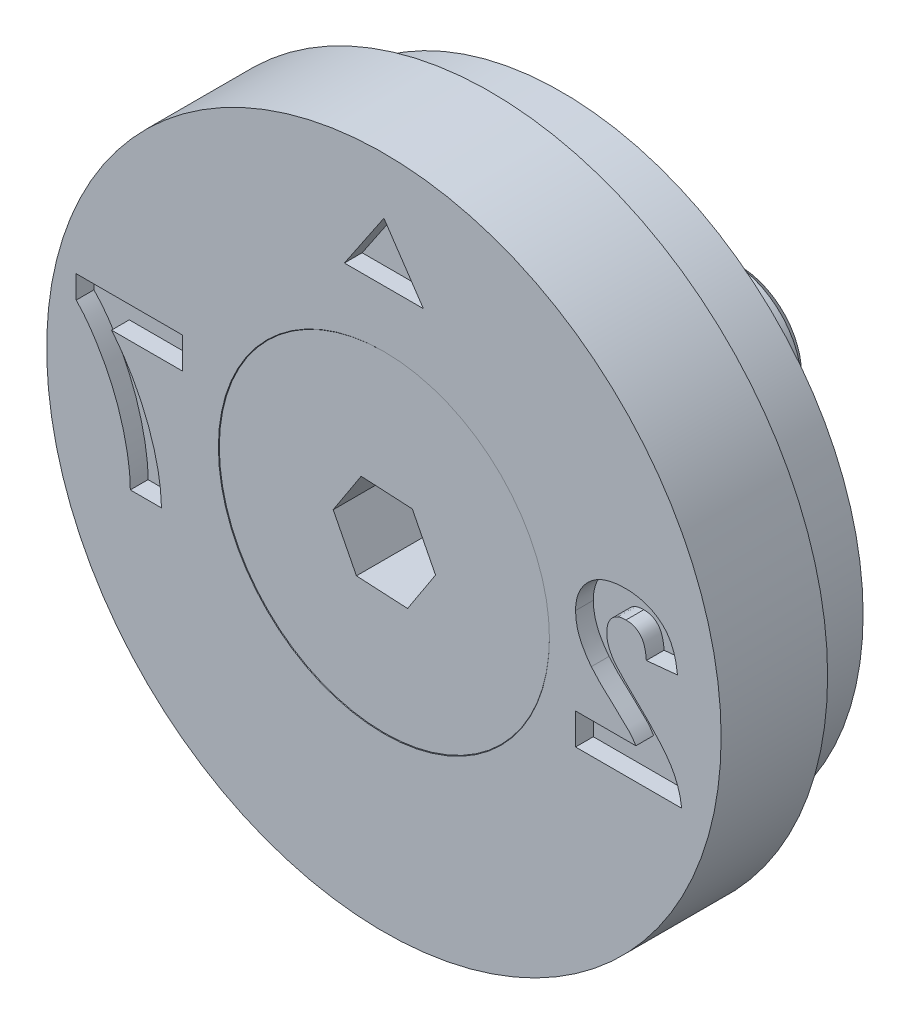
ISO-10303-21;
HEADER;
FILE_DESCRIPTION(('STEP AP214'),'2;1');
FILE_NAME('part.step','',(''),(''),'','','');
FILE_SCHEMA(('AUTOMOTIVE_DESIGN { 1 0 10303 214 1 1 1 1 }'));
ENDSEC;
DATA;
#1=APPLICATION_CONTEXT('core data for automotive mechanical design processes');
#2=APPLICATION_PROTOCOL_DEFINITION('international standard','automotive_design',2000,#1);
#3=PRODUCT_CONTEXT('',#1,'mechanical');
#4=PRODUCT('Part','Part','',(#3));
#5=PRODUCT_RELATED_PRODUCT_CATEGORY('part','',(#4));
#6=PRODUCT_DEFINITION_FORMATION('','',#4);
#7=PRODUCT_DEFINITION_CONTEXT('part definition',#1,'design');
#8=PRODUCT_DEFINITION('design','',#6,#7);
#9=PRODUCT_DEFINITION_SHAPE('','',#8);
#10=(LENGTH_UNIT() NAMED_UNIT(*) SI_UNIT(.MILLI.,.METRE.));
#11=(NAMED_UNIT(*) PLANE_ANGLE_UNIT() SI_UNIT($,.RADIAN.));
#12=(NAMED_UNIT(*) SI_UNIT($,.STERADIAN.) SOLID_ANGLE_UNIT());
#13=UNCERTAINTY_MEASURE_WITH_UNIT(LENGTH_MEASURE(1.E-05),#10,'distance_accuracy_value','');
#14=(GEOMETRIC_REPRESENTATION_CONTEXT(3) GLOBAL_UNCERTAINTY_ASSIGNED_CONTEXT((#13)) GLOBAL_UNIT_ASSIGNED_CONTEXT((#10,
#11,#12)) REPRESENTATION_CONTEXT('',''));
#15=CARTESIAN_POINT('',(0.,0.,0.));
#16=DIRECTION('',(0.,0.,1.));
#17=DIRECTION('',(1.,0.,0.));
#18=AXIS2_PLACEMENT_3D('',#15,#16,#17);
#19=CARTESIAN_POINT('',(0.,0.,-0.0130000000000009));
#20=DIRECTION('',(0.,0.,1.));
#21=DIRECTION('',(1.,0.,0.));
#22=AXIS2_PLACEMENT_3D('',#19,#20,#21);
#23=CYLINDRICAL_SURFACE('',#22,2.);
#24=CARTESIAN_POINT('',(0.,0.,-2.663));
#25=DIRECTION('',(0.,0.,1.));
#26=DIRECTION('',(1.,0.,0.));
#27=AXIS2_PLACEMENT_3D('',#24,#25,#26);
#28=CIRCLE('',#27,2.);
#29=CARTESIAN_POINT('',(2.,0.,-2.663));
#30=VERTEX_POINT('',#29);
#31=EDGE_CURVE('E12',#30,#30,#28,.T.);
#32=ORIENTED_EDGE('',*,*,#31,.F.);
#33=EDGE_LOOP('',(#32));
#34=FACE_BOUND('',#33,.T.);
#35=CARTESIAN_POINT('',(0.,0.,-9.763));
#36=DIRECTION('',(0.,0.,1.));
#37=DIRECTION('',(1.,0.,0.));
#38=AXIS2_PLACEMENT_3D('',#35,#36,#37);
#39=CIRCLE('',#38,2.);
#40=CARTESIAN_POINT('',(2.,0.,-9.763));
#41=VERTEX_POINT('',#40);
#42=EDGE_CURVE('E150',#41,#41,#39,.T.);
#43=ORIENTED_EDGE('',*,*,#42,.T.);
#44=EDGE_LOOP('',(#43));
#45=FACE_BOUND('',#44,.T.);
#46=ADVANCED_FACE('F49',(#34,#45),#23,.T.);
#47=CARTESIAN_POINT('',(0.,0.,-2.663));
#48=DIRECTION('',(0.,0.,1.));
#49=DIRECTION('',(1.,0.,0.));
#50=AXIS2_PLACEMENT_3D('',#47,#48,#49);
#51=CONICAL_SURFACE('',#50,2.,0.785398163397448);
#52=CARTESIAN_POINT('',(0.,0.,-0.0130000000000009));
#53=DIRECTION('',(0.,0.,1.));
#54=DIRECTION('',(1.,0.,0.));
#55=AXIS2_PLACEMENT_3D('',#52,#53,#54);
#56=CIRCLE('',#55,4.65);
#57=CARTESIAN_POINT('',(4.65,0.,-0.0130000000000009));
#58=VERTEX_POINT('',#57);
#59=EDGE_CURVE('E56',#58,#58,#56,.T.);
#60=ORIENTED_EDGE('',*,*,#59,.F.);
#61=EDGE_LOOP('',(#60));
#62=FACE_BOUND('',#61,.T.);
#63=ORIENTED_EDGE('',*,*,#31,.T.);
#64=EDGE_LOOP('',(#63));
#65=FACE_BOUND('',#64,.T.);
#66=ADVANCED_FACE('F165',(#62,#65),#51,.T.);
#67=CARTESIAN_POINT('',(0.,4.65,-0.0130000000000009));
#68=DIRECTION('',(0.,0.,-1.));
#69=DIRECTION('',(-1.,0.,0.));
#70=AXIS2_PLACEMENT_3D('',#67,#68,#69);
#71=PLANE('',#70);
#72=DIRECTION('',(0.99860351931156,-0.0528300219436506,0.));
#73=VECTOR('',#72,1.);
#74=CARTESIAN_POINT('',(-0.786717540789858,-1.21012761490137,-0.0130000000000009));
#75=LINE('',#74,#73);
#76=CARTESIAN_POINT('',(-0.786717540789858,-1.21012761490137,-0.0130000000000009));
#77=VERTEX_POINT('',#76);
#78=CARTESIAN_POINT('',(0.654642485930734,-1.28638118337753,-0.0130000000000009));
#79=VERTEX_POINT('',#78);
#80=EDGE_CURVE('E137',#77,#79,#75,.T.);
#81=ORIENTED_EDGE('',*,*,#80,.F.);
#82=DIRECTION('',(0.453549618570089,-0.891231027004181,0.));
#83=VECTOR('',#82,1.);
#84=CARTESIAN_POINT('',(-1.44136002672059,0.076253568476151,-0.0130000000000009));
#85=LINE('',#84,#83);
#86=CARTESIAN_POINT('',(-1.44136002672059,0.076253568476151,-0.0130000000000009));
#87=VERTEX_POINT('',#86);
#88=EDGE_CURVE('E63',#87,#77,#85,.T.);
#89=ORIENTED_EDGE('',*,*,#88,.F.);
#90=DIRECTION('',(-0.545053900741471,-0.83840100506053,0.));
#91=VECTOR('',#90,1.);
#92=CARTESIAN_POINT('',(-0.654642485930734,1.28638118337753,-0.0130000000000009));
#93=LINE('',#92,#91);
#94=CARTESIAN_POINT('',(-0.654642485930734,1.28638118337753,-0.0130000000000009));
#95=VERTEX_POINT('',#94);
#96=EDGE_CURVE('E146',#95,#87,#93,.T.);
#97=ORIENTED_EDGE('',*,*,#96,.F.);
#98=DIRECTION('',(-0.99860351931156,0.0528300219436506,0.));
#99=VECTOR('',#98,1.);
#100=CARTESIAN_POINT('',(0.786717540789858,1.21012761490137,-0.0130000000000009));
#101=LINE('',#100,#99);
#102=CARTESIAN_POINT('',(0.786717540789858,1.21012761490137,-0.0130000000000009));
#103=VERTEX_POINT('',#102);
#104=EDGE_CURVE('E144',#103,#95,#101,.T.);
#105=ORIENTED_EDGE('',*,*,#104,.F.);
#106=DIRECTION('',(-0.45354961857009,0.891231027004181,0.));
#107=VECTOR('',#106,1.);
#108=CARTESIAN_POINT('',(1.44136002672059,-0.0762535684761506,-0.0130000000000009));
#109=LINE('',#108,#107);
#110=CARTESIAN_POINT('',(1.44136002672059,-0.0762535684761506,-0.0130000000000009));
#111=VERTEX_POINT('',#110);
#112=EDGE_CURVE('E111',#111,#103,#109,.T.);
#113=ORIENTED_EDGE('',*,*,#112,.F.);
#114=DIRECTION('',(0.545053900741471,0.83840100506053,0.));
#115=VECTOR('',#114,1.);
#116=CARTESIAN_POINT('',(0.654642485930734,-1.28638118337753,-0.0130000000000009));
#117=LINE('',#116,#115);
#118=EDGE_CURVE('E140',#79,#111,#117,.T.);
#119=ORIENTED_EDGE('',*,*,#118,.F.);
#120=EDGE_LOOP('',(#81,#89,#97,#105,#113,#119));
#121=FACE_BOUND('',#120,.T.);
#122=ORIENTED_EDGE('',*,*,#59,.T.);
#123=EDGE_LOOP('',(#122));
#124=FACE_BOUND('',#123,.T.);
#125=ADVANCED_FACE('F163',(#121,#124),#71,.F.);
#126=CARTESIAN_POINT('',(0.,0.,-10.013));
#127=DIRECTION('',(0.,0.,1.));
#128=DIRECTION('',(1.,0.,0.));
#129=AXIS2_PLACEMENT_3D('',#126,#127,#128);
#130=PLANE('',#129);
#131=CARTESIAN_POINT('',(0.,0.,-10.013));
#132=DIRECTION('',(0.,0.,1.));
#133=DIRECTION('',(1.,0.,0.));
#134=AXIS2_PLACEMENT_3D('',#131,#132,#133);
#135=CIRCLE('',#134,1.75);
#136=CARTESIAN_POINT('',(1.75,0.,-10.013));
#137=VERTEX_POINT('',#136);
#138=EDGE_CURVE('E158',#137,#137,#135,.T.);
#139=ORIENTED_EDGE('',*,*,#138,.F.);
#140=EDGE_LOOP('',(#139));
#141=FACE_BOUND('',#140,.T.);
#142=ADVANCED_FACE('F178',(#141),#130,.F.);
#143=CARTESIAN_POINT('',(0.,0.,-10.013));
#144=DIRECTION('',(0.,0.,1.));
#145=DIRECTION('',(1.,0.,0.));
#146=AXIS2_PLACEMENT_3D('',#143,#144,#145);
#147=CONICAL_SURFACE('',#146,1.75,0.78539816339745);
#148=ORIENTED_EDGE('',*,*,#42,.F.);
#149=EDGE_LOOP('',(#148));
#150=FACE_BOUND('',#149,.T.);
#151=ORIENTED_EDGE('',*,*,#138,.T.);
#152=EDGE_LOOP('',(#151));
#153=FACE_BOUND('',#152,.T.);
#154=ADVANCED_FACE('F174',(#150,#153),#147,.T.);
#155=CARTESIAN_POINT('',(-1.44136002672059,0.076253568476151,-2.013));
#156=DIRECTION('',(-0.891231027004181,-0.453549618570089,0.));
#157=DIRECTION('',(0.453549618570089,-0.891231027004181,0.));
#158=AXIS2_PLACEMENT_3D('',#155,#156,#157);
#159=PLANE('',#158);
#160=ORIENTED_EDGE('',*,*,#88,.T.);
#161=DIRECTION('',(0.,0.,1.));
#162=VECTOR('',#161,1.);
#163=CARTESIAN_POINT('',(-0.786717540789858,-1.21012761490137,-2.013));
#164=LINE('',#163,#162);
#165=CARTESIAN_POINT('',(-0.786717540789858,-1.21012761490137,-2.013));
#166=VERTEX_POINT('',#165);
#167=EDGE_CURVE('E93',#166,#77,#164,.T.);
#168=ORIENTED_EDGE('',*,*,#167,.F.);
#169=DIRECTION('',(0.453549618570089,-0.891231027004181,0.));
#170=VECTOR('',#169,1.);
#171=CARTESIAN_POINT('',(-1.44136002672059,0.076253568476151,-2.013));
#172=LINE('',#171,#170);
#173=CARTESIAN_POINT('',(-1.44136002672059,0.076253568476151,-2.013));
#174=VERTEX_POINT('',#173);
#175=EDGE_CURVE('E148',#174,#166,#172,.T.);
#176=ORIENTED_EDGE('',*,*,#175,.F.);
#177=DIRECTION('',(0.,0.,1.));
#178=VECTOR('',#177,1.);
#179=CARTESIAN_POINT('',(-1.44136002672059,0.076253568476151,-2.013));
#180=LINE('',#179,#178);
#181=EDGE_CURVE('E71',#174,#87,#180,.T.);
#182=ORIENTED_EDGE('',*,*,#181,.T.);
#183=EDGE_LOOP('',(#160,#168,#176,#182));
#184=FACE_BOUND('',#183,.T.);
#185=ADVANCED_FACE('F177',(#184),#159,.F.);
#186=CARTESIAN_POINT('',(-0.654642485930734,1.28638118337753,-2.013));
#187=DIRECTION('',(-0.83840100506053,0.545053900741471,0.));
#188=DIRECTION('',(-0.54505390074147,-0.83840100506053,0.));
#189=AXIS2_PLACEMENT_3D('',#186,#187,#188);
#190=PLANE('',#189);
#191=ORIENTED_EDGE('',*,*,#96,.T.);
#192=ORIENTED_EDGE('',*,*,#181,.F.);
#193=DIRECTION('',(-0.545053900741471,-0.83840100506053,0.));
#194=VECTOR('',#193,1.);
#195=CARTESIAN_POINT('',(-0.654642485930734,1.28638118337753,-2.013));
#196=LINE('',#195,#194);
#197=CARTESIAN_POINT('',(-0.654642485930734,1.28638118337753,-2.013));
#198=VERTEX_POINT('',#197);
#199=EDGE_CURVE('E123',#198,#174,#196,.T.);
#200=ORIENTED_EDGE('',*,*,#199,.F.);
#201=DIRECTION('',(0.,0.,1.));
#202=VECTOR('',#201,1.);
#203=CARTESIAN_POINT('',(-0.654642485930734,1.28638118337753,-2.013));
#204=LINE('',#203,#202);
#205=EDGE_CURVE('E115',#198,#95,#204,.T.);
#206=ORIENTED_EDGE('',*,*,#205,.T.);
#207=EDGE_LOOP('',(#191,#192,#200,#206));
#208=FACE_BOUND('',#207,.T.);
#209=ADVANCED_FACE('F192',(#208),#190,.F.);
#210=CARTESIAN_POINT('',(0.786717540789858,1.21012761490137,-2.013));
#211=DIRECTION('',(0.0528300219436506,0.99860351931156,0.));
#212=DIRECTION('',(-0.99860351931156,0.0528300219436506,0.));
#213=AXIS2_PLACEMENT_3D('',#210,#211,#212);
#214=PLANE('',#213);
#215=ORIENTED_EDGE('',*,*,#104,.T.);
#216=ORIENTED_EDGE('',*,*,#205,.F.);
#217=DIRECTION('',(-0.99860351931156,0.0528300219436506,0.));
#218=VECTOR('',#217,1.);
#219=CARTESIAN_POINT('',(0.786717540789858,1.21012761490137,-2.013));
#220=LINE('',#219,#218);
#221=CARTESIAN_POINT('',(0.786717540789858,1.21012761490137,-2.013));
#222=VERTEX_POINT('',#221);
#223=EDGE_CURVE('E119',#222,#198,#220,.T.);
#224=ORIENTED_EDGE('',*,*,#223,.F.);
#225=DIRECTION('',(0.,0.,1.));
#226=VECTOR('',#225,1.);
#227=CARTESIAN_POINT('',(0.786717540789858,1.21012761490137,-2.013));
#228=LINE('',#227,#226);
#229=EDGE_CURVE('E104',#222,#103,#228,.T.);
#230=ORIENTED_EDGE('',*,*,#229,.T.);
#231=EDGE_LOOP('',(#215,#216,#224,#230));
#232=FACE_BOUND('',#231,.T.);
#233=ADVANCED_FACE('F120',(#232),#214,.F.);
#234=CARTESIAN_POINT('',(1.44136002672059,-0.0762535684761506,-2.013));
#235=DIRECTION('',(0.89123102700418,0.45354961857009,0.));
#236=DIRECTION('',(-0.45354961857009,0.891231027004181,0.));
#237=AXIS2_PLACEMENT_3D('',#234,#235,#236);
#238=PLANE('',#237);
#239=ORIENTED_EDGE('',*,*,#112,.T.);
#240=ORIENTED_EDGE('',*,*,#229,.F.);
#241=DIRECTION('',(-0.45354961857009,0.891231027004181,0.));
#242=VECTOR('',#241,1.);
#243=CARTESIAN_POINT('',(1.44136002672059,-0.0762535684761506,-2.013));
#244=LINE('',#243,#242);
#245=CARTESIAN_POINT('',(1.44136002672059,-0.0762535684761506,-2.013));
#246=VERTEX_POINT('',#245);
#247=EDGE_CURVE('E108',#246,#222,#244,.T.);
#248=ORIENTED_EDGE('',*,*,#247,.F.);
#249=DIRECTION('',(0.,0.,1.));
#250=VECTOR('',#249,1.);
#251=CARTESIAN_POINT('',(1.44136002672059,-0.0762535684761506,-2.013));
#252=LINE('',#251,#250);
#253=EDGE_CURVE('E116',#246,#111,#252,.T.);
#254=ORIENTED_EDGE('',*,*,#253,.T.);
#255=EDGE_LOOP('',(#239,#240,#248,#254));
#256=FACE_BOUND('',#255,.T.);
#257=ADVANCED_FACE('F106',(#256),#238,.F.);
#258=CARTESIAN_POINT('',(0.654642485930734,-1.28638118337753,-2.013));
#259=DIRECTION('',(0.83840100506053,-0.545053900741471,0.));
#260=DIRECTION('',(0.54505390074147,0.83840100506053,0.));
#261=AXIS2_PLACEMENT_3D('',#258,#259,#260);
#262=PLANE('',#261);
#263=ORIENTED_EDGE('',*,*,#118,.T.);
#264=ORIENTED_EDGE('',*,*,#253,.F.);
#265=DIRECTION('',(0.545053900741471,0.83840100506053,0.));
#266=VECTOR('',#265,1.);
#267=CARTESIAN_POINT('',(0.654642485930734,-1.28638118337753,-2.013));
#268=LINE('',#267,#266);
#269=CARTESIAN_POINT('',(0.654642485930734,-1.28638118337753,-2.013));
#270=VERTEX_POINT('',#269);
#271=EDGE_CURVE('E129',#270,#246,#268,.T.);
#272=ORIENTED_EDGE('',*,*,#271,.F.);
#273=DIRECTION('',(0.,0.,1.));
#274=VECTOR('',#273,1.);
#275=CARTESIAN_POINT('',(0.654642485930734,-1.28638118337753,-2.013));
#276=LINE('',#275,#274);
#277=EDGE_CURVE('E153',#270,#79,#276,.T.);
#278=ORIENTED_EDGE('',*,*,#277,.T.);
#279=EDGE_LOOP('',(#263,#264,#272,#278));
#280=FACE_BOUND('',#279,.T.);
#281=ADVANCED_FACE('F196',(#280),#262,.F.);
#282=CARTESIAN_POINT('',(-0.786717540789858,-1.21012761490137,-2.013));
#283=DIRECTION('',(-0.0528300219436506,-0.99860351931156,0.));
#284=DIRECTION('',(0.99860351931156,-0.0528300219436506,0.));
#285=AXIS2_PLACEMENT_3D('',#282,#283,#284);
#286=PLANE('',#285);
#287=ORIENTED_EDGE('',*,*,#80,.T.);
#288=ORIENTED_EDGE('',*,*,#277,.F.);
#289=DIRECTION('',(0.99860351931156,-0.0528300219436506,0.));
#290=VECTOR('',#289,1.);
#291=CARTESIAN_POINT('',(-0.786717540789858,-1.21012761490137,-2.013));
#292=LINE('',#291,#290);
#293=EDGE_CURVE('E131',#166,#270,#292,.T.);
#294=ORIENTED_EDGE('',*,*,#293,.F.);
#295=ORIENTED_EDGE('',*,*,#167,.T.);
#296=EDGE_LOOP('',(#287,#288,#294,#295));
#297=FACE_BOUND('',#296,.T.);
#298=ADVANCED_FACE('F193',(#297),#286,.F.);
#299=CARTESIAN_POINT('',(0.,0.,-2.013));
#300=DIRECTION('',(0.,0.,1.));
#301=DIRECTION('',(1.,0.,0.));
#302=AXIS2_PLACEMENT_3D('',#299,#300,#301);
#303=PLANE('',#302);
#304=ORIENTED_EDGE('',*,*,#175,.T.);
#305=ORIENTED_EDGE('',*,*,#293,.T.);
#306=ORIENTED_EDGE('',*,*,#271,.T.);
#307=ORIENTED_EDGE('',*,*,#247,.T.);
#308=ORIENTED_EDGE('',*,*,#223,.T.);
#309=ORIENTED_EDGE('',*,*,#199,.T.);
#310=EDGE_LOOP('',(#304,#305,#306,#307,#308,#309));
#311=FACE_BOUND('',#310,.T.);
#312=ADVANCED_FACE('F126',(#311),#303,.T.);
#313=CLOSED_SHELL('',(#46,#66,#125,#142,#154,#185,#209,#233,#257,#281,#298,#312));
#314=MANIFOLD_SOLID_BREP('B2',#313);
#315=CARTESIAN_POINT('',(0.,0.,3.12219627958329));
#316=DIRECTION('',(0.,0.,1.));
#317=DIRECTION('',(1.,0.,0.));
#318=AXIS2_PLACEMENT_3D('',#315,#316,#317);
#319=CYLINDRICAL_SURFACE('',#318,9.5);
#320=CARTESIAN_POINT('',(0.,0.,0.));
#321=DIRECTION('',(0.,0.,1.));
#322=DIRECTION('',(1.,0.,0.));
#323=AXIS2_PLACEMENT_3D('',#320,#321,#322);
#324=CIRCLE('',#323,9.5);
#325=CARTESIAN_POINT('',(9.5,0.,0.));
#326=VERTEX_POINT('',#325);
#327=EDGE_CURVE('E47',#326,#326,#324,.T.);
#328=ORIENTED_EDGE('',*,*,#327,.F.);
#329=EDGE_LOOP('',(#328));
#330=FACE_BOUND('',#329,.T.);
#331=CARTESIAN_POINT('',(0.,0.,-3.));
#332=DIRECTION('',(0.,0.,1.));
#333=DIRECTION('',(1.,0.,0.));
#334=AXIS2_PLACEMENT_3D('',#331,#332,#333);
#335=CIRCLE('',#334,9.5);
#336=CARTESIAN_POINT('',(9.5,0.,-3.));
#337=VERTEX_POINT('',#336);
#338=EDGE_CURVE('E611',#337,#337,#335,.T.);
#339=ORIENTED_EDGE('',*,*,#338,.T.);
#340=EDGE_LOOP('',(#339));
#341=FACE_BOUND('',#340,.T.);
#342=ADVANCED_FACE('F308',(#330,#341),#319,.T.);
#343=CARTESIAN_POINT('',(0.,9.5,0.));
#344=DIRECTION('',(0.,0.,-1.));
#345=DIRECTION('',(-1.,0.,0.));
#346=AXIS2_PLACEMENT_3D('',#343,#344,#345);
#347=PLANE('',#346);
#348=DIRECTION('',(0.,-1.,0.));
#349=VECTOR('',#348,1.);
#350=CARTESIAN_POINT('',(5.39930380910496,-1.40676923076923,0.));
#351=LINE('',#350,#349);
#352=CARTESIAN_POINT('',(5.39930380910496,-1.40676923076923,0.));
#353=VERTEX_POINT('',#352);
#354=CARTESIAN_POINT('',(5.39930380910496,-2.286,0.));
#355=VERTEX_POINT('',#354);
#356=EDGE_CURVE('E820',#353,#355,#351,.T.);
#357=ORIENTED_EDGE('',*,*,#356,.F.);
#358=DIRECTION('',(-1.,0.,0.));
#359=VECTOR('',#358,1.);
#360=CARTESIAN_POINT('',(7.09823409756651,-1.40676923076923,0.));
#361=LINE('',#360,#359);
#362=CARTESIAN_POINT('',(7.09823409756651,-1.40676923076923,0.));
#363=VERTEX_POINT('',#362);
#364=EDGE_CURVE('E322',#363,#353,#361,.T.);
#365=ORIENTED_EDGE('',*,*,#364,.F.);
#366=CARTESIAN_POINT('',(5.84258265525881,-0.104408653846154,0.));
#367=CARTESIAN_POINT('',(5.85648881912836,-0.121923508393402,0.));
#368=CARTESIAN_POINT('',(5.88627259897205,-0.159436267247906,0.));
#369=CARTESIAN_POINT('',(5.9369426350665,-0.216956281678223,0.));
#370=CARTESIAN_POINT('',(5.99566484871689,-0.279786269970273,0.));
#371=CARTESIAN_POINT('',(6.06160981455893,-0.349102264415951,0.));
#372=CARTESIAN_POINT('',(6.13695582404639,-0.422449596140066,0.));
#373=CARTESIAN_POINT('',(6.21899192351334,-0.502895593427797,0.));
#374=CARTESIAN_POINT('',(6.31132794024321,-0.586325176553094,0.));
#375=CARTESIAN_POINT('',(6.40696567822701,-0.674819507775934,0.));
#376=CARTESIAN_POINT('',(6.50301912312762,-0.760949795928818,0.));
#377=CARTESIAN_POINT('',(6.59130608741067,-0.842754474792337,0.));
#378=CARTESIAN_POINT('',(6.67150002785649,-0.915134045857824,0.));
#379=CARTESIAN_POINT('',(6.73986616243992,-0.98208419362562,0.));
#380=CARTESIAN_POINT('',(6.80042577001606,-1.03903561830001,0.));
#381=CARTESIAN_POINT('',(6.85099608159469,-1.08890872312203,0.));
#382=CARTESIAN_POINT('',(6.89252338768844,-1.13049612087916,0.));
#383=CARTESIAN_POINT('',(6.94974534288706,-1.19532032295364,0.));
#384=CARTESIAN_POINT('',(7.02255378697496,-1.28299508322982,0.));
#385=CARTESIAN_POINT('',(7.07377750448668,-1.36677079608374,0.));
#386=CARTESIAN_POINT('',(7.09823409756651,-1.40676923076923,0.));
#387=B_SPLINE_CURVE_WITH_KNOTS('',3,(#366,#367,#368,#369,#370,#371,#372,#373,#374,#375,#376,
#377,#378,#379,#380,#381,#382,#383,#384,#385,#386),.UNSPECIFIED.,.F.,.F.,(4,1,1,1,1,1,1,1,1,1,1,
1,1,1,1,1,1,1,4),(0.,0.0369753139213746,0.0791925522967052,0.126700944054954,0.17918407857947,
0.23736864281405,0.300558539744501,0.369153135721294,0.443112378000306,0.516018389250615,
0.582473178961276,0.642136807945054,0.694619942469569,0.740679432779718,0.779589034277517,
0.812073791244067,0.837814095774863,0.922564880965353,1.),.UNSPECIFIED.);
#388=CARTESIAN_POINT('',(5.84258265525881,-0.104408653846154,0.));
#389=VERTEX_POINT('',#388);
#390=EDGE_CURVE('E483',#389,#363,#387,.T.);
#391=ORIENTED_EDGE('',*,*,#390,.F.);
#392=CARTESIAN_POINT('',(5.39930380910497,1.04225480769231,0.));
#393=CARTESIAN_POINT('',(5.40042239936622,0.992417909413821,0.));
#394=CARTESIAN_POINT('',(5.4026415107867,0.893549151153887,0.));
#395=CARTESIAN_POINT('',(5.42388785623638,0.747391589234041,0.));
#396=CARTESIAN_POINT('',(5.45634813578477,0.604604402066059,0.));
#397=CARTESIAN_POINT('',(5.50432187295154,0.4648386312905,0.));
#398=CARTESIAN_POINT('',(5.56513230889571,0.324741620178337,0.));
#399=CARTESIAN_POINT('',(5.64351841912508,0.183998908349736,0.));
#400=CARTESIAN_POINT('',(5.73453062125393,0.0383659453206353,0.));
#401=CARTESIAN_POINT('',(5.80578958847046,-0.0557921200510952,0.));
#402=CARTESIAN_POINT('',(5.84258265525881,-0.104408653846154,0.));
#403=B_SPLINE_CURVE_WITH_KNOTS('',3,(#392,#393,#394,#395,#396,#397,#398,#399,#400,#401,#402),
.UNSPECIFIED.,.F.,.F.,(4,1,1,1,1,1,1,1,4),(0.,0.119176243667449,0.236427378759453,
0.352663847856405,0.469086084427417,0.589462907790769,0.71760146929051,0.854189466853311,1.),.UNSPECIFIED.);
#404=CARTESIAN_POINT('',(5.39930380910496,1.04225480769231,0.));
#405=VERTEX_POINT('',#404);
#406=EDGE_CURVE('E486',#405,#389,#403,.T.);
#407=ORIENTED_EDGE('',*,*,#406,.F.);
#408=CARTESIAN_POINT('',(6.80240957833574,2.286,0.));
#409=CARTESIAN_POINT('',(6.74925005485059,2.28497830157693,0.));
#410=CARTESIAN_POINT('',(6.6457152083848,2.282988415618,0.));
#411=CARTESIAN_POINT('',(6.49457271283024,2.26655592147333,0.));
#412=CARTESIAN_POINT('',(6.35258519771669,2.23790348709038,0.));
#413=CARTESIAN_POINT('',(6.21851130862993,2.19994928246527,0.));
#414=CARTESIAN_POINT('',(6.0937279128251,2.14927764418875,0.));
#415=CARTESIAN_POINT('',(5.97719519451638,2.08801774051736,0.));
#416=CARTESIAN_POINT('',(5.87074717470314,2.01384463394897,0.));
#417=CARTESIAN_POINT('',(5.7727971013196,1.93080329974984,0.));
#418=CARTESIAN_POINT('',(5.68523757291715,1.8394847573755,0.));
#419=CARTESIAN_POINT('',(5.60854334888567,1.74207809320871,0.));
#420=CARTESIAN_POINT('',(5.54428918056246,1.63865117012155,0.));
#421=CARTESIAN_POINT('',(5.49037006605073,1.53046464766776,0.));
#422=CARTESIAN_POINT('',(5.4503354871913,1.41577764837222,0.));
#423=CARTESIAN_POINT('',(5.42116455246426,1.29617597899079,0.));
#424=CARTESIAN_POINT('',(5.4018230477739,1.17110167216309,0.));
#425=CARTESIAN_POINT('',(5.40015284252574,1.0856787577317,0.));
#426=CARTESIAN_POINT('',(5.39930380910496,1.04225480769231,0.));
#427=B_SPLINE_CURVE_WITH_KNOTS('',3,(#408,#409,#410,#411,#412,#413,#414,#415,#416,#417,#418,
#419,#420,#421,#422,#423,#424,#425,#426),.UNSPECIFIED.,.F.,.F.,(4,1,1,1,1,1,1,1,1,1,1,1,1,1,1,1,
4),(0.,0.07567230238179,0.147381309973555,0.216084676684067,0.28169803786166,0.34545988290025,
0.407485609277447,0.46873129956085,0.529782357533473,0.590032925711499,0.648548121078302,
0.70595351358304,0.763101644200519,0.820289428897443,0.878479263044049,0.938226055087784,1.),.UNSPECIFIED.);
#428=CARTESIAN_POINT('',(6.80240957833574,2.286,0.));
#429=VERTEX_POINT('',#428);
#430=EDGE_CURVE('E755',#429,#405,#427,.T.);
#431=ORIENTED_EDGE('',*,*,#430,.F.);
#432=CARTESIAN_POINT('',(8.27145765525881,0.906706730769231,0.));
#433=CARTESIAN_POINT('',(8.26438877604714,0.966065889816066,0.));
#434=CARTESIAN_POINT('',(8.25068334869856,1.08115381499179,0.));
#435=CARTESIAN_POINT('',(8.21648122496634,1.24645975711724,0.));
#436=CARTESIAN_POINT('',(8.17316550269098,1.39896195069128,0.));
#437=CARTESIAN_POINT('',(8.11867117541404,1.5383773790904,0.));
#438=CARTESIAN_POINT('',(8.05525055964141,1.66559258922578,0.));
#439=CARTESIAN_POINT('',(7.97966867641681,1.778698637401,0.));
#440=CARTESIAN_POINT('',(7.89456643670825,1.8789484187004,0.));
#441=CARTESIAN_POINT('',(7.79987029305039,1.96628857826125,0.));
#442=CARTESIAN_POINT('',(7.69618225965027,2.04099696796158,0.));
#443=CARTESIAN_POINT('',(7.58738027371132,2.1076856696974,0.));
#444=CARTESIAN_POINT('',(7.47133804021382,2.1623916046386,0.));
#445=CARTESIAN_POINT('',(7.34933318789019,2.207477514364,0.));
#446=CARTESIAN_POINT('',(7.22142085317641,2.24350981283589,0.));
#447=CARTESIAN_POINT('',(7.0870094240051,2.2673338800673,0.));
#448=CARTESIAN_POINT('',(6.94692843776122,2.28409182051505,0.));
#449=CARTESIAN_POINT('',(6.85130857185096,2.2853543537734,0.));
#450=CARTESIAN_POINT('',(6.80240957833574,2.286,0.));
#451=B_SPLINE_CURVE_WITH_KNOTS('',3,(#432,#433,#434,#435,#436,#437,#438,#439,#440,#441,#442,
#443,#444,#445,#446,#447,#448,#449,#450),.UNSPECIFIED.,.F.,.F.,(4,1,1,1,1,1,1,1,1,1,1,1,1,1,1,1,
4),(0.,0.0794357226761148,0.154013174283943,0.224141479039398,0.289934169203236,
0.352732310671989,0.41272577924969,0.470302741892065,0.527168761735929,0.583502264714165,
0.639948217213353,0.696584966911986,0.753726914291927,0.812707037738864,0.872963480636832,
0.93503486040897,1.),.UNSPECIFIED.);
#452=CARTESIAN_POINT('',(8.27145765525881,0.906706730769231,0.));
#453=VERTEX_POINT('',#452);
#454=EDGE_CURVE('E763',#453,#429,#451,.T.);
#455=ORIENTED_EDGE('',*,*,#454,.F.);
#456=DIRECTION('',(0.995240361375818,0.097450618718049,0.));
#457=VECTOR('',#456,1.);
#458=CARTESIAN_POINT('',(7.39222688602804,0.820615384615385,0.));
#459=LINE('',#458,#457);
#460=CARTESIAN_POINT('',(7.39222688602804,0.820615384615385,0.));
#461=VERTEX_POINT('',#460);
#462=EDGE_CURVE('E771',#461,#453,#459,.T.);
#463=ORIENTED_EDGE('',*,*,#462,.F.);
#464=CARTESIAN_POINT('',(6.82072688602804,1.524,0.));
#465=CARTESIAN_POINT('',(6.86060495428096,1.52219327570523,0.));
#466=CARTESIAN_POINT('',(6.93764077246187,1.51870307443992,0.));
#467=CARTESIAN_POINT('',(7.0471253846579,1.48821315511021,0.));
#468=CARTESIAN_POINT('',(7.14290421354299,1.43543189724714,0.));
#469=CARTESIAN_POINT('',(7.21116130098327,1.37528256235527,0.));
#470=CARTESIAN_POINT('',(7.25727220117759,1.3167917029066,0.));
#471=CARTESIAN_POINT('',(7.28869056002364,1.26582077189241,0.));
#472=CARTESIAN_POINT('',(7.31577073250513,1.20790216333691,0.));
#473=CARTESIAN_POINT('',(7.33976602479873,1.14368794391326,0.));
#474=CARTESIAN_POINT('',(7.35871959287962,1.07244247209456,0.));
#475=CARTESIAN_POINT('',(7.37398361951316,0.994708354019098,0.));
#476=CARTESIAN_POINT('',(7.38628421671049,0.910067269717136,0.));
#477=CARTESIAN_POINT('',(7.39019602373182,0.851184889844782,0.));
#478=CARTESIAN_POINT('',(7.39222688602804,0.820615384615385,0.));
#479=B_SPLINE_CURVE_WITH_KNOTS('',3,(#464,#465,#466,#467,#468,#469,#470,#471,#472,#473,#474,
#475,#476,#477,#478),.UNSPECIFIED.,.F.,.F.,(4,1,1,1,1,1,1,1,1,1,1,1,4),(0.,0.116899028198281,
0.225823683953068,0.330086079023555,0.435451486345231,0.490306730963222,0.548244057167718,
0.610766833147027,0.677675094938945,0.749188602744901,0.826858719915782,0.910111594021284,1.),.UNSPECIFIED.);
#480=CARTESIAN_POINT('',(6.82072688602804,1.524,0.));
#481=VERTEX_POINT('',#480);
#482=EDGE_CURVE('E777',#481,#461,#479,.T.);
#483=ORIENTED_EDGE('',*,*,#482,.F.);
#484=CARTESIAN_POINT('',(6.27853457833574,0.924108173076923,0.));
#485=CARTESIAN_POINT('',(6.28018126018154,0.969724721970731,0.));
#486=CARTESIAN_POINT('',(6.28329665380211,1.05602767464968,0.));
#487=CARTESIAN_POINT('',(6.30941976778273,1.1778170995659,0.));
#488=CARTESIAN_POINT('',(6.35574487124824,1.28251236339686,0.));
#489=CARTESIAN_POINT('',(6.41952601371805,1.3704348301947,0.));
#490=CARTESIAN_POINT('',(6.50017739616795,1.43932174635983,0.));
#491=CARTESIAN_POINT('',(6.59446120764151,1.49022249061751,0.));
#492=CARTESIAN_POINT('',(6.70375761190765,1.51836396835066,0.));
#493=CARTESIAN_POINT('',(6.7805775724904,1.52206545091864,0.));
#494=CARTESIAN_POINT('',(6.82072688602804,1.524,0.));
#495=B_SPLINE_CURVE_WITH_KNOTS('',3,(#484,#485,#486,#487,#488,#489,#490,#491,#492,#493,#494),
.UNSPECIFIED.,.F.,.F.,(4,1,1,1,1,1,1,1,4),(0.,0.149140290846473,0.282161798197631,
0.404655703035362,0.521109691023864,0.634416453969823,0.748796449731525,0.868710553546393,1.),.UNSPECIFIED.);
#496=CARTESIAN_POINT('',(6.27853457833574,0.924108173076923,0.));
#497=VERTEX_POINT('',#496);
#498=EDGE_CURVE('E782',#497,#481,#495,.T.);
#499=ORIENTED_EDGE('',*,*,#498,.F.);
#500=CARTESIAN_POINT('',(6.45254900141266,0.395653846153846,0.));
#501=CARTESIAN_POINT('',(6.42607734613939,0.439626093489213,0.));
#502=CARTESIAN_POINT('',(6.37501659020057,0.524443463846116,0.));
#503=CARTESIAN_POINT('',(6.31902423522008,0.657820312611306,0.));
#504=CARTESIAN_POINT('',(6.28541553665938,0.791169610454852,0.));
#505=CARTESIAN_POINT('',(6.28080351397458,0.88027284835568,0.));
#506=CARTESIAN_POINT('',(6.27853457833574,0.924108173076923,0.));
#507=B_SPLINE_CURVE_WITH_KNOTS('',3,(#500,#501,#502,#503,#504,#505,#506),.UNSPECIFIED.,.F.,.F.,
(4,1,1,1,4),(0.,0.272795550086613,0.526191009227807,0.766904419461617,1.),.UNSPECIFIED.);
#508=CARTESIAN_POINT('',(6.45254900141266,0.395653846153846,0.));
#509=VERTEX_POINT('',#508);
#510=EDGE_CURVE('E790',#509,#497,#507,.T.);
#511=ORIENTED_EDGE('',*,*,#510,.F.);
#512=CARTESIAN_POINT('',(7.15227015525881,-0.342533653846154,0.));
#513=CARTESIAN_POINT('',(7.10706665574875,-0.2988999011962,0.));
#514=CARTESIAN_POINT('',(7.02101250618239,-0.215834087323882,0.));
#515=CARTESIAN_POINT('',(6.89847123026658,-0.0968872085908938,0.));
#516=CARTESIAN_POINT('',(6.79074482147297,0.012458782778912,0.));
#517=CARTESIAN_POINT('',(6.69558086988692,0.109370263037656,0.));
#518=CARTESIAN_POINT('',(6.61517779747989,0.196314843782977,0.));
#519=CARTESIAN_POINT('',(6.54847797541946,0.271927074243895,0.));
#520=CARTESIAN_POINT('',(6.49463665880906,0.33651487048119,0.));
#521=CARTESIAN_POINT('',(6.46547615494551,0.377489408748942,0.));
#522=CARTESIAN_POINT('',(6.45254900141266,0.395653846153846,0.));
#523=B_SPLINE_CURVE_WITH_KNOTS('',3,(#512,#513,#514,#515,#516,#517,#518,#519,#520,#521,#522),
.UNSPECIFIED.,.F.,.F.,(4,1,1,1,1,1,1,1,4),(0.,0.185090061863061,0.352356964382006,
0.503079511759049,0.637279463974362,0.752473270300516,0.85188578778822,0.934339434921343,1.),.UNSPECIFIED.);
#524=CARTESIAN_POINT('',(7.15227015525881,-0.342533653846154,0.));
#525=VERTEX_POINT('',#524);
#526=EDGE_CURVE('E798',#525,#509,#523,.T.);
#527=ORIENTED_EDGE('',*,*,#526,.F.);
#528=CARTESIAN_POINT('',(8.38868842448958,-2.286,0.));
#529=CARTESIAN_POINT('',(8.37856706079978,-2.21085697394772,0.));
#530=CARTESIAN_POINT('',(8.35833000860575,-2.06061305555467,0.));
#531=CARTESIAN_POINT('',(8.29576427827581,-1.84114450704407,0.));
#532=CARTESIAN_POINT('',(8.21226045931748,-1.62698070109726,0.));
#533=CARTESIAN_POINT('',(8.12163292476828,-1.45270334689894,0.));
#534=CARTESIAN_POINT('',(8.03149380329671,-1.31241607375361,0.));
#535=CARTESIAN_POINT('',(7.94971057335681,-1.19746359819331,0.));
#536=CARTESIAN_POINT('',(7.85214618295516,-1.07515909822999,0.));
#537=CARTESIAN_POINT('',(7.74021639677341,-0.944515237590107,0.));
#538=CARTESIAN_POINT('',(7.61453978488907,-0.805123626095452,0.));
#539=CARTESIAN_POINT('',(7.47417871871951,-0.657502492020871,0.));
#540=CARTESIAN_POINT('',(7.31846365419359,-0.502358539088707,0.));
#541=CARTESIAN_POINT('',(7.20891533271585,-0.397008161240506,0.));
#542=CARTESIAN_POINT('',(7.15227015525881,-0.342533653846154,0.));
#543=B_SPLINE_CURVE_WITH_KNOTS('',3,(#528,#529,#530,#531,#532,#533,#534,#535,#536,#537,#538,
#539,#540,#541,#542),.UNSPECIFIED.,.F.,.F.,(4,1,1,1,1,1,1,1,1,1,1,1,4),(0.,0.0963574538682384,
0.192660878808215,0.289454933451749,0.388479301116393,0.441921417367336,0.501521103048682,
0.567882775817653,0.640891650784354,0.720370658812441,0.806636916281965,0.900015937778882,1.),.UNSPECIFIED.);
#544=CARTESIAN_POINT('',(8.38868842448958,-2.286,0.));
#545=VERTEX_POINT('',#544);
#546=EDGE_CURVE('E806',#545,#525,#543,.T.);
#547=ORIENTED_EDGE('',*,*,#546,.F.);
#548=DIRECTION('',(1.,0.,0.));
#549=VECTOR('',#548,1.);
#550=CARTESIAN_POINT('',(5.39930380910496,-2.286,0.));
#551=LINE('',#550,#549);
#552=EDGE_CURVE('E814',#355,#545,#551,.T.);
#553=ORIENTED_EDGE('',*,*,#552,.F.);
#554=EDGE_LOOP('',(#357,#365,#391,#407,#431,#455,#463,#483,#499,#511,#527,#547,#553));
#555=FACE_BOUND('',#554,.T.);
#556=DIRECTION('',(0.,1.,0.));
#557=VECTOR('',#556,1.);
#558=CARTESIAN_POINT('',(-5.67900388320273,1.34815384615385,0.));
#559=LINE('',#558,#557);
#560=CARTESIAN_POINT('',(-5.67900388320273,1.34815384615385,0.));
#561=VERTEX_POINT('',#560);
#562=CARTESIAN_POINT('',(-5.67900388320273,2.22738461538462,0.));
#563=VERTEX_POINT('',#562);
#564=EDGE_CURVE('E548',#561,#563,#559,.T.);
#565=ORIENTED_EDGE('',*,*,#564,.F.);
#566=DIRECTION('',(1.,0.,0.));
#567=VECTOR('',#566,1.);
#568=CARTESIAN_POINT('',(-7.67284282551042,1.34815384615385,0.));
#569=LINE('',#568,#567);
#570=CARTESIAN_POINT('',(-7.67284282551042,1.34815384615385,0.));
#571=VERTEX_POINT('',#570);
#572=EDGE_CURVE('E330',#571,#561,#569,.T.);
#573=ORIENTED_EDGE('',*,*,#572,.F.);
#574=CARTESIAN_POINT('',(-6.26515772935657,-2.286,0.));
#575=CARTESIAN_POINT('',(-6.2680976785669,-2.20811047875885,0.));
#576=CARTESIAN_POINT('',(-6.27401023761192,-2.05146614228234,0.));
#577=CARTESIAN_POINT('',(-6.29613178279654,-1.81634810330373,0.));
#578=CARTESIAN_POINT('',(-6.33087604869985,-1.58035458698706,0.));
#579=CARTESIAN_POINT('',(-6.37403075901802,-1.34294016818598,0.));
#580=CARTESIAN_POINT('',(-6.43100573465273,-1.10468282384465,0.));
#581=CARTESIAN_POINT('',(-6.4960316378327,-0.86469997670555,0.));
#582=CARTESIAN_POINT('',(-6.5748007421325,-0.624273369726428,0.));
#583=CARTESIAN_POINT('',(-6.66309879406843,-0.383862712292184,0.));
#584=CARTESIAN_POINT('',(-6.7605752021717,-0.145750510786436,0.));
#585=CARTESIAN_POINT('',(-6.86681077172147,0.0871098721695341,0.));
#586=CARTESIAN_POINT('',(-6.9815308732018,0.313265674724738,0.));
#587=CARTESIAN_POINT('',(-7.10324359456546,0.533511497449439,0.));
#588=CARTESIAN_POINT('',(-7.23336488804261,0.747138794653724,0.));
#589=CARTESIAN_POINT('',(-7.37199272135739,0.953915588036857,0.));
#590=CARTESIAN_POINT('',(-7.51716069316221,1.15533763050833,0.));
#591=CARTESIAN_POINT('',(-7.62095752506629,1.28389260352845,0.));
#592=CARTESIAN_POINT('',(-7.67284282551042,1.34815384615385,0.));
#593=B_SPLINE_CURVE_WITH_KNOTS('',3,(#574,#575,#576,#577,#578,#579,#580,#581,#582,#583,#584,
#585,#586,#587,#588,#589,#590,#591,#592),.UNSPECIFIED.,.F.,.F.,(4,1,1,1,1,1,1,1,1,1,1,1,1,1,1,1,
4),(0.,0.0589531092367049,0.118561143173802,0.178522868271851,0.239353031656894,
0.301026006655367,0.363773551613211,0.427382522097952,0.492333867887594,0.557475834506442,
0.621960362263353,0.685889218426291,0.749254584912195,0.812267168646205,0.875035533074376,
0.937533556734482,1.),.UNSPECIFIED.);
#594=CARTESIAN_POINT('',(-6.26515772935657,-2.286,0.));
#595=VERTEX_POINT('',#594);
#596=EDGE_CURVE('E568',#595,#571,#593,.T.);
#597=ORIENTED_EDGE('',*,*,#596,.F.);
#598=DIRECTION('',(1.,0.,0.));
#599=VECTOR('',#598,1.);
#600=CARTESIAN_POINT('',(-7.14438849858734,-2.286,0.));
#601=LINE('',#600,#599);
#602=CARTESIAN_POINT('',(-7.14438849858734,-2.286,0.));
#603=VERTEX_POINT('',#602);
#604=EDGE_CURVE('E562',#603,#595,#601,.T.);
#605=ORIENTED_EDGE('',*,*,#604,.F.);
#606=CARTESIAN_POINT('',(-8.66838849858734,1.58261538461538,0.));
#607=CARTESIAN_POINT('',(-8.6372035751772,1.55088574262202,0.));
#608=CARTESIAN_POINT('',(-8.57309633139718,1.48565871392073,0.));
#609=CARTESIAN_POINT('',(-8.48126897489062,1.37890819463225,0.));
#610=CARTESIAN_POINT('',(-8.38808107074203,1.26306514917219,0.));
#611=CARTESIAN_POINT('',(-8.2954812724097,1.13656859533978,0.));
#612=CARTESIAN_POINT('',(-8.20059116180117,1.00141676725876,0.));
#613=CARTESIAN_POINT('',(-8.1075808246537,0.855018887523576,0.));
#614=CARTESIAN_POINT('',(-8.01324753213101,0.699274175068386,0.));
#615=CARTESIAN_POINT('',(-7.88624509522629,0.478972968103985,0.));
#616=CARTESIAN_POINT('',(-7.73779509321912,0.191191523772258,0.));
#617=CARTESIAN_POINT('',(-7.580742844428,-0.166535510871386,0.));
#618=CARTESIAN_POINT('',(-7.44694151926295,-0.535248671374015,0.));
#619=CARTESIAN_POINT('',(-7.35532024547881,-0.849419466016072,0.));
#620=CARTESIAN_POINT('',(-7.29341532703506,-1.1012268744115,0.));
#621=CARTESIAN_POINT('',(-7.25296964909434,-1.28535441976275,0.));
#622=CARTESIAN_POINT('',(-7.21892297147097,-1.46430037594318,0.));
#623=CARTESIAN_POINT('',(-7.19122602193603,-1.63837923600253,0.));
#624=CARTESIAN_POINT('',(-7.17055500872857,-1.80767041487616,0.));
#625=CARTESIAN_POINT('',(-7.15422138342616,-1.97158534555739,0.));
#626=CARTESIAN_POINT('',(-7.14616306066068,-2.13052373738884,0.));
#627=CARTESIAN_POINT('',(-7.14497397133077,-2.23470446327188,0.));
#628=CARTESIAN_POINT('',(-7.14438849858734,-2.286,0.));
#629=B_SPLINE_CURVE_WITH_KNOTS('',3,(#606,#607,#608,#609,#610,#611,#612,#613,#614,#615,#616,
#617,#618,#619,#620,#621,#622,#623,#624,#625,#626,#627,#628),.UNSPECIFIED.,.F.,.F.,(4,1,1,1,1,1,
1,1,1,1,1,1,1,1,1,1,1,1,1,1,4),(0.,0.0314272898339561,0.0646054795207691,0.0994393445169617,
0.136456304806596,0.175351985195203,0.216100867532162,0.258977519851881,0.304007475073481,
0.395756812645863,0.487615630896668,0.579873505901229,0.672707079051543,0.718694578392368,
0.76307923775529,0.805893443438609,0.847386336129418,0.88760014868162,0.926386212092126,
0.963754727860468,1.),.UNSPECIFIED.);
#630=CARTESIAN_POINT('',(-8.66838849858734,1.58261538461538,0.));
#631=VERTEX_POINT('',#630);
#632=EDGE_CURVE('E557',#631,#603,#629,.T.);
#633=ORIENTED_EDGE('',*,*,#632,.F.);
#634=DIRECTION('',(0.,-1.,0.));
#635=VECTOR('',#634,1.);
#636=CARTESIAN_POINT('',(-8.66838849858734,2.22738461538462,0.));
#637=LINE('',#636,#635);
#638=CARTESIAN_POINT('',(-8.66838849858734,2.22738461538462,0.));
#639=VERTEX_POINT('',#638);
#640=EDGE_CURVE('E554',#639,#631,#637,.T.);
#641=ORIENTED_EDGE('',*,*,#640,.F.);
#642=DIRECTION('',(-1.,0.,0.));
#643=VECTOR('',#642,1.);
#644=CARTESIAN_POINT('',(-5.67900388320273,2.22738461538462,0.));
#645=LINE('',#644,#643);
#646=EDGE_CURVE('E551',#563,#639,#645,.T.);
#647=ORIENTED_EDGE('',*,*,#646,.F.);
#648=EDGE_LOOP('',(#565,#573,#597,#605,#633,#641,#647));
#649=FACE_BOUND('',#648,.T.);
#650=DIRECTION('',(-0.559192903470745,0.829037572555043,0.));
#651=VECTOR('',#650,1.);
#652=CARTESIAN_POINT('',(1.11293905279,6.264516,0.));
#653=LINE('',#652,#651);
#654=CARTESIAN_POINT('',(1.11293905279,6.264516,0.));
#655=VERTEX_POINT('',#654);
#656=CARTESIAN_POINT('',(0.,7.914516,0.));
#657=VERTEX_POINT('',#656);
#658=EDGE_CURVE('E603',#655,#657,#653,.T.);
#659=ORIENTED_EDGE('',*,*,#658,.F.);
#660=DIRECTION('',(1.,0.,0.));
#661=VECTOR('',#660,1.);
#662=CARTESIAN_POINT('',(-1.11293905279,6.264516,0.));
#663=LINE('',#662,#661);
#664=CARTESIAN_POINT('',(-1.11293905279,6.264516,0.));
#665=VERTEX_POINT('',#664);
#666=EDGE_CURVE('E601',#665,#655,#663,.T.);
#667=ORIENTED_EDGE('',*,*,#666,.F.);
#668=DIRECTION('',(-0.559192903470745,-0.829037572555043,0.));
#669=VECTOR('',#668,1.);
#670=CARTESIAN_POINT('',(0.,7.914516,0.));
#671=LINE('',#670,#669);
#672=EDGE_CURVE('E594',#657,#665,#671,.T.);
#673=ORIENTED_EDGE('',*,*,#672,.F.);
#674=EDGE_LOOP('',(#659,#667,#673));
#675=FACE_BOUND('',#674,.T.);
#676=CARTESIAN_POINT('',(0.,0.,0.));
#677=DIRECTION('',(0.,0.,1.));
#678=DIRECTION('',(1.,0.,0.));
#679=AXIS2_PLACEMENT_3D('',#676,#677,#678);
#680=CIRCLE('',#679,4.663);
#681=CARTESIAN_POINT('',(4.663,0.,0.));
#682=VERTEX_POINT('',#681);
#683=EDGE_CURVE('E315',#682,#682,#680,.T.);
#684=ORIENTED_EDGE('',*,*,#683,.F.);
#685=EDGE_LOOP('',(#684));
#686=FACE_BOUND('',#685,.T.);
#687=ORIENTED_EDGE('',*,*,#327,.T.);
#688=EDGE_LOOP('',(#687));
#689=FACE_BOUND('',#688,.T.);
#690=ADVANCED_FACE('F634',(#555,#649,#675,#686,#689),#347,.F.);
#691=CARTESIAN_POINT('',(0.,0.,0.));
#692=DIRECTION('',(0.,0.,1.));
#693=DIRECTION('',(1.,0.,0.));
#694=AXIS2_PLACEMENT_3D('',#691,#692,#693);
#695=CONICAL_SURFACE('',#694,4.663,0.785398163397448);
#696=CARTESIAN_POINT('',(0.,0.,-2.663));
#697=DIRECTION('',(0.,0.,1.));
#698=DIRECTION('',(1.,0.,0.));
#699=AXIS2_PLACEMENT_3D('',#696,#697,#698);
#700=CIRCLE('',#699,2.);
#701=CARTESIAN_POINT('',(2.,0.,-2.663));
#702=VERTEX_POINT('',#701);
#703=EDGE_CURVE('E627',#702,#702,#700,.T.);
#704=ORIENTED_EDGE('',*,*,#703,.F.);
#705=EDGE_LOOP('',(#704));
#706=FACE_BOUND('',#705,.T.);
#707=ORIENTED_EDGE('',*,*,#683,.T.);
#708=EDGE_LOOP('',(#707));
#709=FACE_BOUND('',#708,.T.);
#710=ADVANCED_FACE('F632',(#706,#709),#695,.F.);
#711=CARTESIAN_POINT('',(0.,0.,3.12219627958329));
#712=DIRECTION('',(0.,0.,1.));
#713=DIRECTION('',(1.,0.,0.));
#714=AXIS2_PLACEMENT_3D('',#711,#712,#713);
#715=CYLINDRICAL_SURFACE('',#714,2.);
#716=CARTESIAN_POINT('',(0.,0.,-5.));
#717=DIRECTION('',(0.,0.,1.));
#718=DIRECTION('',(1.,0.,0.));
#719=AXIS2_PLACEMENT_3D('',#716,#717,#718);
#720=CIRCLE('',#719,2.);
#721=CARTESIAN_POINT('',(2.,0.,-5.));
#722=VERTEX_POINT('',#721);
#723=EDGE_CURVE('E624',#722,#722,#720,.T.);
#724=ORIENTED_EDGE('',*,*,#723,.F.);
#725=EDGE_LOOP('',(#724));
#726=FACE_BOUND('',#725,.T.);
#727=ORIENTED_EDGE('',*,*,#703,.T.);
#728=EDGE_LOOP('',(#727));
#729=FACE_BOUND('',#728,.T.);
#730=ADVANCED_FACE('F660',(#726,#729),#715,.F.);
#731=CARTESIAN_POINT('',(0.,2.,-5.));
#732=DIRECTION('',(0.,0.,1.));
#733=DIRECTION('',(1.,0.,0.));
#734=AXIS2_PLACEMENT_3D('',#731,#732,#733);
#735=PLANE('',#734);
#736=CARTESIAN_POINT('',(0.,0.,-5.));
#737=DIRECTION('',(0.,0.,1.));
#738=DIRECTION('',(1.,0.,0.));
#739=AXIS2_PLACEMENT_3D('',#736,#737,#738);
#740=CIRCLE('',#739,8.5);
#741=CARTESIAN_POINT('',(8.5,0.,-5.));
#742=VERTEX_POINT('',#741);
#743=EDGE_CURVE('E621',#742,#742,#740,.T.);
#744=ORIENTED_EDGE('',*,*,#743,.F.);
#745=EDGE_LOOP('',(#744));
#746=FACE_BOUND('',#745,.T.);
#747=ORIENTED_EDGE('',*,*,#723,.T.);
#748=EDGE_LOOP('',(#747));
#749=FACE_BOUND('',#748,.T.);
#750=ADVANCED_FACE('F654',(#746,#749),#735,.F.);
#751=CARTESIAN_POINT('',(0.,0.,3.12219627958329));
#752=DIRECTION('',(0.,0.,1.));
#753=DIRECTION('',(1.,0.,0.));
#754=AXIS2_PLACEMENT_3D('',#751,#752,#753);
#755=CYLINDRICAL_SURFACE('',#754,8.5);
#756=CARTESIAN_POINT('',(0.,0.,-3.));
#757=DIRECTION('',(0.,0.,1.));
#758=DIRECTION('',(1.,0.,0.));
#759=AXIS2_PLACEMENT_3D('',#756,#757,#758);
#760=CIRCLE('',#759,8.5);
#761=CARTESIAN_POINT('',(8.5,0.,-3.));
#762=VERTEX_POINT('',#761);
#763=EDGE_CURVE('E618',#762,#762,#760,.T.);
#764=ORIENTED_EDGE('',*,*,#763,.F.);
#765=EDGE_LOOP('',(#764));
#766=FACE_BOUND('',#765,.T.);
#767=ORIENTED_EDGE('',*,*,#743,.T.);
#768=EDGE_LOOP('',(#767));
#769=FACE_BOUND('',#768,.T.);
#770=ADVANCED_FACE('F648',(#766,#769),#755,.T.);
#771=CARTESIAN_POINT('',(0.,8.5,-3.));
#772=DIRECTION('',(0.,0.,1.));
#773=DIRECTION('',(1.,0.,0.));
#774=AXIS2_PLACEMENT_3D('',#771,#772,#773);
#775=PLANE('',#774);
#776=ORIENTED_EDGE('',*,*,#338,.F.);
#777=EDGE_LOOP('',(#776));
#778=FACE_BOUND('',#777,.T.);
#779=ORIENTED_EDGE('',*,*,#763,.T.);
#780=EDGE_LOOP('',(#779));
#781=FACE_BOUND('',#780,.T.);
#782=ADVANCED_FACE('F644',(#778,#781),#775,.F.);
#783=CARTESIAN_POINT('',(-1.11293905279,6.264516,-0.5));
#784=DIRECTION('',(0.,-1.,0.));
#785=DIRECTION('',(0.,0.,-1.));
#786=AXIS2_PLACEMENT_3D('',#783,#784,#785);
#787=PLANE('',#786);
#788=ORIENTED_EDGE('',*,*,#666,.T.);
#789=DIRECTION('',(0.,0.,1.));
#790=VECTOR('',#789,1.);
#791=CARTESIAN_POINT('',(1.11293905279,6.264516,-0.5));
#792=LINE('',#791,#790);
#793=CARTESIAN_POINT('',(1.11293905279,6.264516,-0.5));
#794=VERTEX_POINT('',#793);
#795=EDGE_CURVE('E600',#794,#655,#792,.T.);
#796=ORIENTED_EDGE('',*,*,#795,.F.);
#797=DIRECTION('',(1.,0.,0.));
#798=VECTOR('',#797,1.);
#799=CARTESIAN_POINT('',(-1.11293905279,6.264516,-0.5));
#800=LINE('',#799,#798);
#801=CARTESIAN_POINT('',(-1.11293905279,6.264516,-0.5));
#802=VERTEX_POINT('',#801);
#803=EDGE_CURVE('E590',#802,#794,#800,.T.);
#804=ORIENTED_EDGE('',*,*,#803,.F.);
#805=DIRECTION('',(0.,0.,1.));
#806=VECTOR('',#805,1.);
#807=CARTESIAN_POINT('',(-1.11293905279,6.264516,-0.5));
#808=LINE('',#807,#806);
#809=EDGE_CURVE('E609',#802,#665,#808,.T.);
#810=ORIENTED_EDGE('',*,*,#809,.T.);
#811=EDGE_LOOP('',(#788,#796,#804,#810));
#812=FACE_BOUND('',#811,.T.);
#813=ADVANCED_FACE('F647',(#812),#787,.F.);
#814=CARTESIAN_POINT('',(0.,7.914516,-0.5));
#815=DIRECTION('',(-0.829037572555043,0.559192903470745,0.));
#816=DIRECTION('',(-0.559192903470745,-0.829037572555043,0.));
#817=AXIS2_PLACEMENT_3D('',#814,#815,#816);
#818=PLANE('',#817);
#819=ORIENTED_EDGE('',*,*,#672,.T.);
#820=ORIENTED_EDGE('',*,*,#809,.F.);
#821=DIRECTION('',(-0.559192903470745,-0.829037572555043,0.));
#822=VECTOR('',#821,1.);
#823=CARTESIAN_POINT('',(0.,7.914516,-0.5));
#824=LINE('',#823,#822);
#825=CARTESIAN_POINT('',(0.,7.914516,-0.5));
#826=VERTEX_POINT('',#825);
#827=EDGE_CURVE('E597',#826,#802,#824,.T.);
#828=ORIENTED_EDGE('',*,*,#827,.F.);
#829=DIRECTION('',(0.,0.,1.));
#830=VECTOR('',#829,1.);
#831=CARTESIAN_POINT('',(0.,7.914516,-0.5));
#832=LINE('',#831,#830);
#833=EDGE_CURVE('E612',#826,#657,#832,.T.);
#834=ORIENTED_EDGE('',*,*,#833,.T.);
#835=EDGE_LOOP('',(#819,#820,#828,#834));
#836=FACE_BOUND('',#835,.T.);
#837=ADVANCED_FACE('F676',(#836),#818,.F.);
#838=CARTESIAN_POINT('',(1.11293905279,6.264516,-0.5));
#839=DIRECTION('',(0.829037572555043,0.559192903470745,0.));
#840=DIRECTION('',(-0.559192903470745,0.829037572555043,0.));
#841=AXIS2_PLACEMENT_3D('',#838,#839,#840);
#842=PLANE('',#841);
#843=ORIENTED_EDGE('',*,*,#658,.T.);
#844=ORIENTED_EDGE('',*,*,#833,.F.);
#845=DIRECTION('',(-0.559192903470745,0.829037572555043,0.));
#846=VECTOR('',#845,1.);
#847=CARTESIAN_POINT('',(1.11293905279,6.264516,-0.5));
#848=LINE('',#847,#846);
#849=EDGE_CURVE('E593',#794,#826,#848,.T.);
#850=ORIENTED_EDGE('',*,*,#849,.F.);
#851=ORIENTED_EDGE('',*,*,#795,.T.);
#852=EDGE_LOOP('',(#843,#844,#850,#851));
#853=FACE_BOUND('',#852,.T.);
#854=ADVANCED_FACE('F678',(#853),#842,.F.);
#855=CARTESIAN_POINT('',(1.11293905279,6.264516,-0.5));
#856=DIRECTION('',(0.,0.,1.));
#857=DIRECTION('',(1.,0.,0.));
#858=AXIS2_PLACEMENT_3D('',#855,#856,#857);
#859=PLANE('',#858);
#860=ORIENTED_EDGE('',*,*,#803,.T.);
#861=ORIENTED_EDGE('',*,*,#849,.T.);
#862=ORIENTED_EDGE('',*,*,#827,.T.);
#863=EDGE_LOOP('',(#860,#861,#862));
#864=FACE_BOUND('',#863,.T.);
#865=ADVANCED_FACE('F681',(#864),#859,.T.);
#866=CARTESIAN_POINT('',(-7.67284282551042,1.34815384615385,-0.5));
#867=DIRECTION('',(0.,-1.,0.));
#868=DIRECTION('',(0.,0.,-1.));
#869=AXIS2_PLACEMENT_3D('',#866,#867,#868);
#870=PLANE('',#869);
#871=ORIENTED_EDGE('',*,*,#572,.T.);
#872=DIRECTION('',(0.,0.,1.));
#873=VECTOR('',#872,1.);
#874=CARTESIAN_POINT('',(-5.67900388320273,1.34815384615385,-0.5));
#875=LINE('',#874,#873);
#876=CARTESIAN_POINT('',(-5.67900388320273,1.34815384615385,-0.5));
#877=VERTEX_POINT('',#876);
#878=EDGE_CURVE('E541',#877,#561,#875,.T.);
#879=ORIENTED_EDGE('',*,*,#878,.F.);
#880=DIRECTION('',(1.,0.,0.));
#881=VECTOR('',#880,1.);
#882=CARTESIAN_POINT('',(-7.67284282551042,1.34815384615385,-0.5));
#883=LINE('',#882,#881);
#884=CARTESIAN_POINT('',(-7.67284282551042,1.34815384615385,-0.5));
#885=VERTEX_POINT('',#884);
#886=EDGE_CURVE('E573',#885,#877,#883,.T.);
#887=ORIENTED_EDGE('',*,*,#886,.F.);
#888=DIRECTION('',(0.,0.,1.));
#889=VECTOR('',#888,1.);
#890=CARTESIAN_POINT('',(-7.67284282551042,1.34815384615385,-0.5));
#891=LINE('',#890,#889);
#892=EDGE_CURVE('E574',#885,#571,#891,.T.);
#893=ORIENTED_EDGE('',*,*,#892,.T.);
#894=EDGE_LOOP('',(#871,#879,#887,#893));
#895=FACE_BOUND('',#894,.T.);
#896=ADVANCED_FACE('F531',(#895),#870,.F.);
#897=CARTESIAN_POINT('',(-6.26515772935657,-2.286,-0.5));
#898=CARTESIAN_POINT('',(-6.2680976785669,-2.20811047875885,-0.5));
#899=CARTESIAN_POINT('',(-6.27401023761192,-2.05146614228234,-0.5));
#900=CARTESIAN_POINT('',(-6.29613178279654,-1.81634810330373,-0.5));
#901=CARTESIAN_POINT('',(-6.33087604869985,-1.58035458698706,-0.5));
#902=CARTESIAN_POINT('',(-6.37403075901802,-1.34294016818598,-0.5));
#903=CARTESIAN_POINT('',(-6.43100573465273,-1.10468282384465,-0.5));
#904=CARTESIAN_POINT('',(-6.4960316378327,-0.86469997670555,-0.5));
#905=CARTESIAN_POINT('',(-6.5748007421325,-0.624273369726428,-0.5));
#906=CARTESIAN_POINT('',(-6.66309879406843,-0.383862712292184,-0.5));
#907=CARTESIAN_POINT('',(-6.7605752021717,-0.145750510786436,-0.5));
#908=CARTESIAN_POINT('',(-6.86681077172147,0.0871098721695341,-0.5));
#909=CARTESIAN_POINT('',(-6.9815308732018,0.313265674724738,-0.5));
#910=CARTESIAN_POINT('',(-7.10324359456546,0.533511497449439,-0.5));
#911=CARTESIAN_POINT('',(-7.23336488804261,0.747138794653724,-0.5));
#912=CARTESIAN_POINT('',(-7.37199272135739,0.953915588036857,-0.5));
#913=CARTESIAN_POINT('',(-7.51716069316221,1.15533763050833,-0.5));
#914=CARTESIAN_POINT('',(-7.62095752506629,1.28389260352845,-0.5));
#915=CARTESIAN_POINT('',(-7.67284282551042,1.34815384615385,-0.5));
#916=B_SPLINE_CURVE_WITH_KNOTS('',3,(#897,#898,#899,#900,#901,#902,#903,#904,#905,#906,#907,
#908,#909,#910,#911,#912,#913,#914,#915),.UNSPECIFIED.,.F.,.F.,(4,1,1,1,1,1,1,1,1,1,1,1,1,1,1,1,
4),(0.,0.0589531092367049,0.118561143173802,0.178522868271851,0.239353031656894,
0.301026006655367,0.363773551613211,0.427382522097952,0.492333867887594,0.557475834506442,
0.621960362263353,0.685889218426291,0.749254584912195,0.812267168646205,0.875035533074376,
0.937533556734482,1.),.UNSPECIFIED.);
#917=DIRECTION('',(0.,0.,1.));
#918=VECTOR('',#917,1.);
#919=SURFACE_OF_LINEAR_EXTRUSION('',#916,#918);
#920=ORIENTED_EDGE('',*,*,#596,.T.);
#921=ORIENTED_EDGE('',*,*,#892,.F.);
#922=CARTESIAN_POINT('',(-6.26515772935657,-2.286,-0.5));
#923=VERTEX_POINT('',#922);
#924=EDGE_CURVE('E534',#923,#885,#916,.T.);
#925=ORIENTED_EDGE('',*,*,#924,.F.);
#926=DIRECTION('',(0.,0.,1.));
#927=VECTOR('',#926,1.);
#928=CARTESIAN_POINT('',(-6.26515772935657,-2.286,-0.5));
#929=LINE('',#928,#927);
#930=EDGE_CURVE('E579',#923,#595,#929,.T.);
#931=ORIENTED_EDGE('',*,*,#930,.T.);
#932=EDGE_LOOP('',(#920,#921,#925,#931));
#933=FACE_BOUND('',#932,.T.);
#934=ADVANCED_FACE('F526',(#933),#919,.F.);
#935=CARTESIAN_POINT('',(-7.14438849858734,-2.286,-0.5));
#936=DIRECTION('',(0.,-1.,0.));
#937=DIRECTION('',(0.,0.,-1.));
#938=AXIS2_PLACEMENT_3D('',#935,#936,#937);
#939=PLANE('',#938);
#940=ORIENTED_EDGE('',*,*,#604,.T.);
#941=ORIENTED_EDGE('',*,*,#930,.F.);
#942=DIRECTION('',(1.,0.,0.));
#943=VECTOR('',#942,1.);
#944=CARTESIAN_POINT('',(-7.14438849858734,-2.286,-0.5));
#945=LINE('',#944,#943);
#946=CARTESIAN_POINT('',(-7.14438849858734,-2.286,-0.5));
#947=VERTEX_POINT('',#946);
#948=EDGE_CURVE('E542',#947,#923,#945,.T.);
#949=ORIENTED_EDGE('',*,*,#948,.F.);
#950=DIRECTION('',(0.,0.,1.));
#951=VECTOR('',#950,1.);
#952=CARTESIAN_POINT('',(-7.14438849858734,-2.286,-0.5));
#953=LINE('',#952,#951);
#954=EDGE_CURVE('E581',#947,#603,#953,.T.);
#955=ORIENTED_EDGE('',*,*,#954,.T.);
#956=EDGE_LOOP('',(#940,#941,#949,#955));
#957=FACE_BOUND('',#956,.T.);
#958=ADVANCED_FACE('F530',(#957),#939,.F.);
#959=CARTESIAN_POINT('',(-8.66838849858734,1.58261538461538,-0.5));
#960=CARTESIAN_POINT('',(-8.6372035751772,1.55088574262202,-0.5));
#961=CARTESIAN_POINT('',(-8.57309633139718,1.48565871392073,-0.5));
#962=CARTESIAN_POINT('',(-8.48126897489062,1.37890819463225,-0.5));
#963=CARTESIAN_POINT('',(-8.38808107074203,1.26306514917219,-0.5));
#964=CARTESIAN_POINT('',(-8.2954812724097,1.13656859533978,-0.5));
#965=CARTESIAN_POINT('',(-8.20059116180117,1.00141676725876,-0.5));
#966=CARTESIAN_POINT('',(-8.1075808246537,0.855018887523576,-0.5));
#967=CARTESIAN_POINT('',(-8.01324753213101,0.699274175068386,-0.5));
#968=CARTESIAN_POINT('',(-7.88624509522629,0.478972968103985,-0.5));
#969=CARTESIAN_POINT('',(-7.73779509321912,0.191191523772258,-0.5));
#970=CARTESIAN_POINT('',(-7.580742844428,-0.166535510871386,-0.5));
#971=CARTESIAN_POINT('',(-7.44694151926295,-0.535248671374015,-0.5));
#972=CARTESIAN_POINT('',(-7.35532024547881,-0.849419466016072,-0.5));
#973=CARTESIAN_POINT('',(-7.29341532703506,-1.1012268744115,-0.5));
#974=CARTESIAN_POINT('',(-7.25296964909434,-1.28535441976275,-0.5));
#975=CARTESIAN_POINT('',(-7.21892297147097,-1.46430037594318,-0.5));
#976=CARTESIAN_POINT('',(-7.19122602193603,-1.63837923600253,-0.5));
#977=CARTESIAN_POINT('',(-7.17055500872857,-1.80767041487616,-0.5));
#978=CARTESIAN_POINT('',(-7.15422138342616,-1.97158534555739,-0.5));
#979=CARTESIAN_POINT('',(-7.14616306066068,-2.13052373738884,-0.5));
#980=CARTESIAN_POINT('',(-7.14497397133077,-2.23470446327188,-0.5));
#981=CARTESIAN_POINT('',(-7.14438849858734,-2.286,-0.5));
#982=B_SPLINE_CURVE_WITH_KNOTS('',3,(#959,#960,#961,#962,#963,#964,#965,#966,#967,#968,#969,
#970,#971,#972,#973,#974,#975,#976,#977,#978,#979,#980,#981),.UNSPECIFIED.,.F.,.F.,(4,1,1,1,1,1,
1,1,1,1,1,1,1,1,1,1,1,1,1,1,4),(0.,0.0314272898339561,0.0646054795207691,0.0994393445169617,
0.136456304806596,0.175351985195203,0.216100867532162,0.258977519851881,0.304007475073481,
0.395756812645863,0.487615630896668,0.579873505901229,0.672707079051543,0.718694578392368,
0.76307923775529,0.805893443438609,0.847386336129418,0.88760014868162,0.926386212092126,
0.963754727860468,1.),.UNSPECIFIED.);
#983=DIRECTION('',(0.,0.,1.));
#984=VECTOR('',#983,1.);
#985=SURFACE_OF_LINEAR_EXTRUSION('',#982,#984);
#986=ORIENTED_EDGE('',*,*,#632,.T.);
#987=ORIENTED_EDGE('',*,*,#954,.F.);
#988=CARTESIAN_POINT('',(-8.66838849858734,1.58261538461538,-0.5));
#989=VERTEX_POINT('',#988);
#990=EDGE_CURVE('E704',#989,#947,#982,.T.);
#991=ORIENTED_EDGE('',*,*,#990,.F.);
#992=DIRECTION('',(0.,0.,1.));
#993=VECTOR('',#992,1.);
#994=CARTESIAN_POINT('',(-8.66838849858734,1.58261538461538,-0.5));
#995=LINE('',#994,#993);
#996=EDGE_CURVE('E583',#989,#631,#995,.T.);
#997=ORIENTED_EDGE('',*,*,#996,.T.);
#998=EDGE_LOOP('',(#986,#987,#991,#997));
#999=FACE_BOUND('',#998,.T.);
#1000=ADVANCED_FACE('F700',(#999),#985,.F.);
#1001=CARTESIAN_POINT('',(-8.66838849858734,2.22738461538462,-0.5));
#1002=DIRECTION('',(-1.,0.,0.));
#1003=DIRECTION('',(0.,0.,1.));
#1004=AXIS2_PLACEMENT_3D('',#1001,#1002,#1003);
#1005=PLANE('',#1004);
#1006=ORIENTED_EDGE('',*,*,#640,.T.);
#1007=ORIENTED_EDGE('',*,*,#996,.F.);
#1008=DIRECTION('',(0.,-1.,0.));
#1009=VECTOR('',#1008,1.);
#1010=CARTESIAN_POINT('',(-8.66838849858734,2.22738461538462,-0.5));
#1011=LINE('',#1010,#1009);
#1012=CARTESIAN_POINT('',(-8.66838849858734,2.22738461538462,-0.5));
#1013=VERTEX_POINT('',#1012);
#1014=EDGE_CURVE('E710',#1013,#989,#1011,.T.);
#1015=ORIENTED_EDGE('',*,*,#1014,.F.);
#1016=DIRECTION('',(0.,0.,1.));
#1017=VECTOR('',#1016,1.);
#1018=CARTESIAN_POINT('',(-8.66838849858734,2.22738461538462,-0.5));
#1019=LINE('',#1018,#1017);
#1020=EDGE_CURVE('E585',#1013,#639,#1019,.T.);
#1021=ORIENTED_EDGE('',*,*,#1020,.T.);
#1022=EDGE_LOOP('',(#1006,#1007,#1015,#1021));
#1023=FACE_BOUND('',#1022,.T.);
#1024=ADVANCED_FACE('F697',(#1023),#1005,.F.);
#1025=CARTESIAN_POINT('',(-5.67900388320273,2.22738461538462,-0.5));
#1026=DIRECTION('',(0.,1.,0.));
#1027=DIRECTION('',(0.,0.,1.));
#1028=AXIS2_PLACEMENT_3D('',#1025,#1026,#1027);
#1029=PLANE('',#1028);
#1030=ORIENTED_EDGE('',*,*,#646,.T.);
#1031=ORIENTED_EDGE('',*,*,#1020,.F.);
#1032=DIRECTION('',(-1.,0.,0.));
#1033=VECTOR('',#1032,1.);
#1034=CARTESIAN_POINT('',(-5.67900388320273,2.22738461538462,-0.5));
#1035=LINE('',#1034,#1033);
#1036=CARTESIAN_POINT('',(-5.67900388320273,2.22738461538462,-0.5));
#1037=VERTEX_POINT('',#1036);
#1038=EDGE_CURVE('E716',#1037,#1013,#1035,.T.);
#1039=ORIENTED_EDGE('',*,*,#1038,.F.);
#1040=DIRECTION('',(0.,0.,1.));
#1041=VECTOR('',#1040,1.);
#1042=CARTESIAN_POINT('',(-5.67900388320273,2.22738461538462,-0.5));
#1043=LINE('',#1042,#1041);
#1044=EDGE_CURVE('E587',#1037,#563,#1043,.T.);
#1045=ORIENTED_EDGE('',*,*,#1044,.T.);
#1046=EDGE_LOOP('',(#1030,#1031,#1039,#1045));
#1047=FACE_BOUND('',#1046,.T.);
#1048=ADVANCED_FACE('F693',(#1047),#1029,.F.);
#1049=CARTESIAN_POINT('',(-5.67900388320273,1.34815384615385,-0.5));
#1050=DIRECTION('',(1.,0.,0.));
#1051=DIRECTION('',(0.,0.,-1.));
#1052=AXIS2_PLACEMENT_3D('',#1049,#1050,#1051);
#1053=PLANE('',#1052);
#1054=ORIENTED_EDGE('',*,*,#564,.T.);
#1055=ORIENTED_EDGE('',*,*,#1044,.F.);
#1056=DIRECTION('',(0.,1.,0.));
#1057=VECTOR('',#1056,1.);
#1058=CARTESIAN_POINT('',(-5.67900388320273,1.34815384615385,-0.5));
#1059=LINE('',#1058,#1057);
#1060=EDGE_CURVE('E719',#877,#1037,#1059,.T.);
#1061=ORIENTED_EDGE('',*,*,#1060,.F.);
#1062=ORIENTED_EDGE('',*,*,#878,.T.);
#1063=EDGE_LOOP('',(#1054,#1055,#1061,#1062));
#1064=FACE_BOUND('',#1063,.T.);
#1065=ADVANCED_FACE('F524',(#1064),#1053,.F.);
#1066=CARTESIAN_POINT('',(-7.56558112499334,-0.216508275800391,-0.5));
#1067=DIRECTION('',(0.,0.,1.));
#1068=DIRECTION('',(1.,0.,0.));
#1069=AXIS2_PLACEMENT_3D('',#1066,#1067,#1068);
#1070=PLANE('',#1069);
#1071=ORIENTED_EDGE('',*,*,#886,.T.);
#1072=ORIENTED_EDGE('',*,*,#1060,.T.);
#1073=ORIENTED_EDGE('',*,*,#1038,.T.);
#1074=ORIENTED_EDGE('',*,*,#1014,.T.);
#1075=ORIENTED_EDGE('',*,*,#990,.T.);
#1076=ORIENTED_EDGE('',*,*,#948,.T.);
#1077=ORIENTED_EDGE('',*,*,#924,.T.);
#1078=EDGE_LOOP('',(#1071,#1072,#1073,#1074,#1075,#1076,#1077));
#1079=FACE_BOUND('',#1078,.T.);
#1080=ADVANCED_FACE('F521',(#1079),#1070,.T.);
#1081=CARTESIAN_POINT('',(7.09823409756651,-1.40676923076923,-0.5));
#1082=DIRECTION('',(0.,1.,0.));
#1083=DIRECTION('',(0.,0.,1.));
#1084=AXIS2_PLACEMENT_3D('',#1081,#1082,#1083);
#1085=PLANE('',#1084);
#1086=ORIENTED_EDGE('',*,*,#364,.T.);
#1087=DIRECTION('',(0.,0.,1.));
#1088=VECTOR('',#1087,1.);
#1089=CARTESIAN_POINT('',(5.39930380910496,-1.40676923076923,-0.5));
#1090=LINE('',#1089,#1088);
#1091=CARTESIAN_POINT('',(5.39930380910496,-1.40676923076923,-0.5));
#1092=VERTEX_POINT('',#1091);
#1093=EDGE_CURVE('E460',#1092,#353,#1090,.T.);
#1094=ORIENTED_EDGE('',*,*,#1093,.F.);
#1095=DIRECTION('',(-1.,0.,0.));
#1096=VECTOR('',#1095,1.);
#1097=CARTESIAN_POINT('',(7.09823409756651,-1.40676923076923,-0.5));
#1098=LINE('',#1097,#1096);
#1099=CARTESIAN_POINT('',(7.09823409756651,-1.40676923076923,-0.5));
#1100=VERTEX_POINT('',#1099);
#1101=EDGE_CURVE('E464',#1100,#1092,#1098,.T.);
#1102=ORIENTED_EDGE('',*,*,#1101,.F.);
#1103=DIRECTION('',(0.,0.,1.));
#1104=VECTOR('',#1103,1.);
#1105=CARTESIAN_POINT('',(7.09823409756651,-1.40676923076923,-0.5));
#1106=LINE('',#1105,#1104);
#1107=EDGE_CURVE('E604',#1100,#363,#1106,.T.);
#1108=ORIENTED_EDGE('',*,*,#1107,.T.);
#1109=EDGE_LOOP('',(#1086,#1094,#1102,#1108));
#1110=FACE_BOUND('',#1109,.T.);
#1111=ADVANCED_FACE('F462',(#1110),#1085,.F.);
#1112=CARTESIAN_POINT('',(5.84258265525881,-0.104408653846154,-0.5));
#1113=CARTESIAN_POINT('',(5.85648881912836,-0.121923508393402,-0.5));
#1114=CARTESIAN_POINT('',(5.88627259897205,-0.159436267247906,-0.5));
#1115=CARTESIAN_POINT('',(5.9369426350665,-0.216956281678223,-0.5));
#1116=CARTESIAN_POINT('',(5.99566484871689,-0.279786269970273,-0.5));
#1117=CARTESIAN_POINT('',(6.06160981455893,-0.349102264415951,-0.5));
#1118=CARTESIAN_POINT('',(6.13695582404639,-0.422449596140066,-0.5));
#1119=CARTESIAN_POINT('',(6.21899192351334,-0.502895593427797,-0.5));
#1120=CARTESIAN_POINT('',(6.31132794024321,-0.586325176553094,-0.5));
#1121=CARTESIAN_POINT('',(6.40696567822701,-0.674819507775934,-0.5));
#1122=CARTESIAN_POINT('',(6.50301912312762,-0.760949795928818,-0.5));
#1123=CARTESIAN_POINT('',(6.59130608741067,-0.842754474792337,-0.5));
#1124=CARTESIAN_POINT('',(6.67150002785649,-0.915134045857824,-0.5));
#1125=CARTESIAN_POINT('',(6.73986616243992,-0.98208419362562,-0.5));
#1126=CARTESIAN_POINT('',(6.80042577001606,-1.03903561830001,-0.5));
#1127=CARTESIAN_POINT('',(6.85099608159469,-1.08890872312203,-0.5));
#1128=CARTESIAN_POINT('',(6.89252338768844,-1.13049612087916,-0.5));
#1129=CARTESIAN_POINT('',(6.94974534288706,-1.19532032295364,-0.5));
#1130=CARTESIAN_POINT('',(7.02255378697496,-1.28299508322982,-0.5));
#1131=CARTESIAN_POINT('',(7.07377750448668,-1.36677079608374,-0.5));
#1132=CARTESIAN_POINT('',(7.09823409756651,-1.40676923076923,-0.5));
#1133=B_SPLINE_CURVE_WITH_KNOTS('',3,(#1112,#1113,#1114,#1115,#1116,#1117,#1118,#1119,#1120,
#1121,#1122,#1123,#1124,#1125,#1126,#1127,#1128,#1129,#1130,#1131,#1132),.UNSPECIFIED.,.F.,.F.,
(4,1,1,1,1,1,1,1,1,1,1,1,1,1,1,1,1,1,4),(0.,0.0369753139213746,0.0791925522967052,
0.126700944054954,0.17918407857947,0.23736864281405,0.300558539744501,0.369153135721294,
0.443112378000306,0.516018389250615,0.582473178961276,0.642136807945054,0.694619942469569,
0.740679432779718,0.779589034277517,0.812073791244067,0.837814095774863,0.922564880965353,1.),.UNSPECIFIED.);
#1134=DIRECTION('',(0.,0.,1.));
#1135=VECTOR('',#1134,1.);
#1136=SURFACE_OF_LINEAR_EXTRUSION('',#1133,#1135);
#1137=ORIENTED_EDGE('',*,*,#390,.T.);
#1138=ORIENTED_EDGE('',*,*,#1107,.F.);
#1139=CARTESIAN_POINT('',(5.84258265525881,-0.104408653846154,-0.5));
#1140=VERTEX_POINT('',#1139);
#1141=EDGE_CURVE('E470',#1140,#1100,#1133,.T.);
#1142=ORIENTED_EDGE('',*,*,#1141,.F.);
#1143=DIRECTION('',(0.,0.,1.));
#1144=VECTOR('',#1143,1.);
#1145=CARTESIAN_POINT('',(5.84258265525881,-0.104408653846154,-0.5));
#1146=LINE('',#1145,#1144);
#1147=EDGE_CURVE('E743',#1140,#389,#1146,.T.);
#1148=ORIENTED_EDGE('',*,*,#1147,.T.);
#1149=EDGE_LOOP('',(#1137,#1138,#1142,#1148));
#1150=FACE_BOUND('',#1149,.T.);
#1151=ADVANCED_FACE('F520',(#1150),#1136,.F.);
#1152=CARTESIAN_POINT('',(5.39930380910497,1.04225480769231,-0.5));
#1153=CARTESIAN_POINT('',(5.40042239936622,0.992417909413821,-0.5));
#1154=CARTESIAN_POINT('',(5.4026415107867,0.893549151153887,-0.5));
#1155=CARTESIAN_POINT('',(5.42388785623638,0.747391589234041,-0.5));
#1156=CARTESIAN_POINT('',(5.45634813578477,0.604604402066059,-0.5));
#1157=CARTESIAN_POINT('',(5.50432187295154,0.4648386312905,-0.5));
#1158=CARTESIAN_POINT('',(5.56513230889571,0.324741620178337,-0.5));
#1159=CARTESIAN_POINT('',(5.64351841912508,0.183998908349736,-0.5));
#1160=CARTESIAN_POINT('',(5.73453062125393,0.0383659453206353,-0.5));
#1161=CARTESIAN_POINT('',(5.80578958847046,-0.0557921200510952,-0.5));
#1162=CARTESIAN_POINT('',(5.84258265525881,-0.104408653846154,-0.5));
#1163=B_SPLINE_CURVE_WITH_KNOTS('',3,(#1152,#1153,#1154,#1155,#1156,#1157,#1158,#1159,#1160,
#1161,#1162),.UNSPECIFIED.,.F.,.F.,(4,1,1,1,1,1,1,1,4),(0.,0.119176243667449,0.236427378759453,
0.352663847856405,0.469086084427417,0.589462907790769,0.71760146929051,0.854189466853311,1.),.UNSPECIFIED.);
#1164=DIRECTION('',(0.,0.,1.));
#1165=VECTOR('',#1164,1.);
#1166=SURFACE_OF_LINEAR_EXTRUSION('',#1163,#1165);
#1167=ORIENTED_EDGE('',*,*,#406,.T.);
#1168=ORIENTED_EDGE('',*,*,#1147,.F.);
#1169=CARTESIAN_POINT('',(5.39930380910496,1.04225480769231,-0.5));
#1170=VERTEX_POINT('',#1169);
#1171=EDGE_CURVE('E827',#1170,#1140,#1163,.T.);
#1172=ORIENTED_EDGE('',*,*,#1171,.F.);
#1173=DIRECTION('',(0.,0.,1.));
#1174=VECTOR('',#1173,1.);
#1175=CARTESIAN_POINT('',(5.39930380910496,1.04225480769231,-0.5));
#1176=LINE('',#1175,#1174);
#1177=EDGE_CURVE('E741',#1170,#405,#1176,.T.);
#1178=ORIENTED_EDGE('',*,*,#1177,.T.);
#1179=EDGE_LOOP('',(#1167,#1168,#1172,#1178));
#1180=FACE_BOUND('',#1179,.T.);
#1181=ADVANCED_FACE('F839',(#1180),#1166,.F.);
#1182=CARTESIAN_POINT('',(6.80240957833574,2.286,-0.5));
#1183=CARTESIAN_POINT('',(6.74925005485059,2.28497830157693,-0.5));
#1184=CARTESIAN_POINT('',(6.6457152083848,2.282988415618,-0.5));
#1185=CARTESIAN_POINT('',(6.49457271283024,2.26655592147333,-0.5));
#1186=CARTESIAN_POINT('',(6.35258519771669,2.23790348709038,-0.5));
#1187=CARTESIAN_POINT('',(6.21851130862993,2.19994928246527,-0.5));
#1188=CARTESIAN_POINT('',(6.0937279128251,2.14927764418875,-0.5));
#1189=CARTESIAN_POINT('',(5.97719519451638,2.08801774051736,-0.5));
#1190=CARTESIAN_POINT('',(5.87074717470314,2.01384463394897,-0.5));
#1191=CARTESIAN_POINT('',(5.7727971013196,1.93080329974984,-0.5));
#1192=CARTESIAN_POINT('',(5.68523757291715,1.8394847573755,-0.5));
#1193=CARTESIAN_POINT('',(5.60854334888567,1.74207809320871,-0.5));
#1194=CARTESIAN_POINT('',(5.54428918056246,1.63865117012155,-0.5));
#1195=CARTESIAN_POINT('',(5.49037006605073,1.53046464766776,-0.5));
#1196=CARTESIAN_POINT('',(5.4503354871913,1.41577764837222,-0.5));
#1197=CARTESIAN_POINT('',(5.42116455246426,1.29617597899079,-0.5));
#1198=CARTESIAN_POINT('',(5.4018230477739,1.17110167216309,-0.5));
#1199=CARTESIAN_POINT('',(5.40015284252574,1.0856787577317,-0.5));
#1200=CARTESIAN_POINT('',(5.39930380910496,1.04225480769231,-0.5));
#1201=B_SPLINE_CURVE_WITH_KNOTS('',3,(#1182,#1183,#1184,#1185,#1186,#1187,#1188,#1189,#1190,
#1191,#1192,#1193,#1194,#1195,#1196,#1197,#1198,#1199,#1200),.UNSPECIFIED.,.F.,.F.,(4,1,1,1,1,1,
1,1,1,1,1,1,1,1,1,1,4),(0.,0.07567230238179,0.147381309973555,0.216084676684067,
0.28169803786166,0.34545988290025,0.407485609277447,0.46873129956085,0.529782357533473,
0.590032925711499,0.648548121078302,0.70595351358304,0.763101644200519,0.820289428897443,
0.878479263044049,0.938226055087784,1.),.UNSPECIFIED.);
#1202=DIRECTION('',(0.,0.,1.));
#1203=VECTOR('',#1202,1.);
#1204=SURFACE_OF_LINEAR_EXTRUSION('',#1201,#1203);
#1205=ORIENTED_EDGE('',*,*,#430,.T.);
#1206=ORIENTED_EDGE('',*,*,#1177,.F.);
#1207=CARTESIAN_POINT('',(6.80240957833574,2.286,-0.5));
#1208=VERTEX_POINT('',#1207);
#1209=EDGE_CURVE('E851',#1208,#1170,#1201,.T.);
#1210=ORIENTED_EDGE('',*,*,#1209,.F.);
#1211=DIRECTION('',(0.,0.,1.));
#1212=VECTOR('',#1211,1.);
#1213=CARTESIAN_POINT('',(6.80240957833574,2.286,-0.5));
#1214=LINE('',#1213,#1212);
#1215=EDGE_CURVE('E739',#1208,#429,#1214,.T.);
#1216=ORIENTED_EDGE('',*,*,#1215,.T.);
#1217=EDGE_LOOP('',(#1205,#1206,#1210,#1216));
#1218=FACE_BOUND('',#1217,.T.);
#1219=ADVANCED_FACE('F843',(#1218),#1204,.F.);
#1220=CARTESIAN_POINT('',(8.27145765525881,0.906706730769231,-0.5));
#1221=CARTESIAN_POINT('',(8.26438877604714,0.966065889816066,-0.5));
#1222=CARTESIAN_POINT('',(8.25068334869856,1.08115381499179,-0.5));
#1223=CARTESIAN_POINT('',(8.21648122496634,1.24645975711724,-0.5));
#1224=CARTESIAN_POINT('',(8.17316550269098,1.39896195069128,-0.5));
#1225=CARTESIAN_POINT('',(8.11867117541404,1.5383773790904,-0.5));
#1226=CARTESIAN_POINT('',(8.05525055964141,1.66559258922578,-0.5));
#1227=CARTESIAN_POINT('',(7.97966867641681,1.778698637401,-0.5));
#1228=CARTESIAN_POINT('',(7.89456643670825,1.8789484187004,-0.5));
#1229=CARTESIAN_POINT('',(7.79987029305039,1.96628857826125,-0.5));
#1230=CARTESIAN_POINT('',(7.69618225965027,2.04099696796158,-0.5));
#1231=CARTESIAN_POINT('',(7.58738027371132,2.1076856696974,-0.5));
#1232=CARTESIAN_POINT('',(7.47133804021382,2.1623916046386,-0.5));
#1233=CARTESIAN_POINT('',(7.34933318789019,2.207477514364,-0.5));
#1234=CARTESIAN_POINT('',(7.22142085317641,2.24350981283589,-0.5));
#1235=CARTESIAN_POINT('',(7.0870094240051,2.2673338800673,-0.5));
#1236=CARTESIAN_POINT('',(6.94692843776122,2.28409182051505,-0.5));
#1237=CARTESIAN_POINT('',(6.85130857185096,2.2853543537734,-0.5));
#1238=CARTESIAN_POINT('',(6.80240957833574,2.286,-0.5));
#1239=B_SPLINE_CURVE_WITH_KNOTS('',3,(#1220,#1221,#1222,#1223,#1224,#1225,#1226,#1227,#1228,
#1229,#1230,#1231,#1232,#1233,#1234,#1235,#1236,#1237,#1238),.UNSPECIFIED.,.F.,.F.,(4,1,1,1,1,1,
1,1,1,1,1,1,1,1,1,1,4),(0.,0.0794357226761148,0.154013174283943,0.224141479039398,
0.289934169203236,0.352732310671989,0.41272577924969,0.470302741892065,0.527168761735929,
0.583502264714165,0.639948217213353,0.696584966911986,0.753726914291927,0.812707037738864,
0.872963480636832,0.93503486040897,1.),.UNSPECIFIED.);
#1240=DIRECTION('',(0.,0.,1.));
#1241=VECTOR('',#1240,1.);
#1242=SURFACE_OF_LINEAR_EXTRUSION('',#1239,#1241);
#1243=ORIENTED_EDGE('',*,*,#454,.T.);
#1244=ORIENTED_EDGE('',*,*,#1215,.F.);
#1245=CARTESIAN_POINT('',(8.27145765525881,0.906706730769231,-0.5));
#1246=VERTEX_POINT('',#1245);
#1247=EDGE_CURVE('E856',#1246,#1208,#1239,.T.);
#1248=ORIENTED_EDGE('',*,*,#1247,.F.);
#1249=DIRECTION('',(0.,0.,1.));
#1250=VECTOR('',#1249,1.);
#1251=CARTESIAN_POINT('',(8.27145765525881,0.906706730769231,-0.5));
#1252=LINE('',#1251,#1250);
#1253=EDGE_CURVE('E737',#1246,#453,#1252,.T.);
#1254=ORIENTED_EDGE('',*,*,#1253,.T.);
#1255=EDGE_LOOP('',(#1243,#1244,#1248,#1254));
#1256=FACE_BOUND('',#1255,.T.);
#1257=ADVANCED_FACE('F847',(#1256),#1242,.F.);
#1258=CARTESIAN_POINT('',(7.39222688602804,0.820615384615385,-0.5));
#1259=DIRECTION('',(0.097450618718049,-0.995240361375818,0.));
#1260=DIRECTION('',(0.995240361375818,0.097450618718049,0.));
#1261=AXIS2_PLACEMENT_3D('',#1258,#1259,#1260);
#1262=PLANE('',#1261);
#1263=ORIENTED_EDGE('',*,*,#462,.T.);
#1264=ORIENTED_EDGE('',*,*,#1253,.F.);
#1265=DIRECTION('',(0.995240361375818,0.097450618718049,0.));
#1266=VECTOR('',#1265,1.);
#1267=CARTESIAN_POINT('',(7.39222688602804,0.820615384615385,-0.5));
#1268=LINE('',#1267,#1266);
#1269=CARTESIAN_POINT('',(7.39222688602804,0.820615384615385,-0.5));
#1270=VERTEX_POINT('',#1269);
#1271=EDGE_CURVE('E865',#1270,#1246,#1268,.T.);
#1272=ORIENTED_EDGE('',*,*,#1271,.F.);
#1273=DIRECTION('',(0.,0.,1.));
#1274=VECTOR('',#1273,1.);
#1275=CARTESIAN_POINT('',(7.39222688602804,0.820615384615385,-0.5));
#1276=LINE('',#1275,#1274);
#1277=EDGE_CURVE('E735',#1270,#461,#1276,.T.);
#1278=ORIENTED_EDGE('',*,*,#1277,.T.);
#1279=EDGE_LOOP('',(#1263,#1264,#1272,#1278));
#1280=FACE_BOUND('',#1279,.T.);
#1281=ADVANCED_FACE('F889',(#1280),#1262,.F.);
#1282=CARTESIAN_POINT('',(6.82072688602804,1.524,-0.5));
#1283=CARTESIAN_POINT('',(6.86060495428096,1.52219327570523,-0.5));
#1284=CARTESIAN_POINT('',(6.93764077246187,1.51870307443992,-0.5));
#1285=CARTESIAN_POINT('',(7.0471253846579,1.48821315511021,-0.5));
#1286=CARTESIAN_POINT('',(7.14290421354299,1.43543189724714,-0.5));
#1287=CARTESIAN_POINT('',(7.21116130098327,1.37528256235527,-0.5));
#1288=CARTESIAN_POINT('',(7.25727220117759,1.3167917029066,-0.5));
#1289=CARTESIAN_POINT('',(7.28869056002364,1.26582077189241,-0.5));
#1290=CARTESIAN_POINT('',(7.31577073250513,1.20790216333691,-0.5));
#1291=CARTESIAN_POINT('',(7.33976602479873,1.14368794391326,-0.5));
#1292=CARTESIAN_POINT('',(7.35871959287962,1.07244247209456,-0.5));
#1293=CARTESIAN_POINT('',(7.37398361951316,0.994708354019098,-0.5));
#1294=CARTESIAN_POINT('',(7.38628421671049,0.910067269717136,-0.5));
#1295=CARTESIAN_POINT('',(7.39019602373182,0.851184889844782,-0.5));
#1296=CARTESIAN_POINT('',(7.39222688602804,0.820615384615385,-0.5));
#1297=B_SPLINE_CURVE_WITH_KNOTS('',3,(#1282,#1283,#1284,#1285,#1286,#1287,#1288,#1289,#1290,
#1291,#1292,#1293,#1294,#1295,#1296),.UNSPECIFIED.,.F.,.F.,(4,1,1,1,1,1,1,1,1,1,1,1,4),(0.,
0.116899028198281,0.225823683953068,0.330086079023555,0.435451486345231,0.490306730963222,
0.548244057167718,0.610766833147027,0.677675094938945,0.749188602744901,0.826858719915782,
0.910111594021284,1.),.UNSPECIFIED.);
#1298=DIRECTION('',(0.,0.,1.));
#1299=VECTOR('',#1298,1.);
#1300=SURFACE_OF_LINEAR_EXTRUSION('',#1297,#1299);
#1301=ORIENTED_EDGE('',*,*,#482,.T.);
#1302=ORIENTED_EDGE('',*,*,#1277,.F.);
#1303=CARTESIAN_POINT('',(6.82072688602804,1.524,-0.5));
#1304=VERTEX_POINT('',#1303);
#1305=EDGE_CURVE('E871',#1304,#1270,#1297,.T.);
#1306=ORIENTED_EDGE('',*,*,#1305,.F.);
#1307=DIRECTION('',(0.,0.,1.));
#1308=VECTOR('',#1307,1.);
#1309=CARTESIAN_POINT('',(6.82072688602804,1.524,-0.5));
#1310=LINE('',#1309,#1308);
#1311=EDGE_CURVE('E733',#1304,#481,#1310,.T.);
#1312=ORIENTED_EDGE('',*,*,#1311,.T.);
#1313=EDGE_LOOP('',(#1301,#1302,#1306,#1312));
#1314=FACE_BOUND('',#1313,.T.);
#1315=ADVANCED_FACE('F885',(#1314),#1300,.F.);
#1316=CARTESIAN_POINT('',(6.27853457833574,0.924108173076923,-0.5));
#1317=CARTESIAN_POINT('',(6.28018126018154,0.969724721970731,-0.5));
#1318=CARTESIAN_POINT('',(6.28329665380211,1.05602767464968,-0.5));
#1319=CARTESIAN_POINT('',(6.30941976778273,1.1778170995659,-0.5));
#1320=CARTESIAN_POINT('',(6.35574487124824,1.28251236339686,-0.5));
#1321=CARTESIAN_POINT('',(6.41952601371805,1.3704348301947,-0.5));
#1322=CARTESIAN_POINT('',(6.50017739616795,1.43932174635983,-0.5));
#1323=CARTESIAN_POINT('',(6.59446120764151,1.49022249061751,-0.5));
#1324=CARTESIAN_POINT('',(6.70375761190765,1.51836396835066,-0.5));
#1325=CARTESIAN_POINT('',(6.7805775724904,1.52206545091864,-0.5));
#1326=CARTESIAN_POINT('',(6.82072688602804,1.524,-0.5));
#1327=B_SPLINE_CURVE_WITH_KNOTS('',3,(#1316,#1317,#1318,#1319,#1320,#1321,#1322,#1323,#1324,
#1325,#1326),.UNSPECIFIED.,.F.,.F.,(4,1,1,1,1,1,1,1,4),(0.,0.149140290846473,0.282161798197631,
0.404655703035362,0.521109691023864,0.634416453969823,0.748796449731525,0.868710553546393,1.),.UNSPECIFIED.);
#1328=DIRECTION('',(0.,0.,1.));
#1329=VECTOR('',#1328,1.);
#1330=SURFACE_OF_LINEAR_EXTRUSION('',#1327,#1329);
#1331=ORIENTED_EDGE('',*,*,#498,.T.);
#1332=ORIENTED_EDGE('',*,*,#1311,.F.);
#1333=CARTESIAN_POINT('',(6.27853457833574,0.924108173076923,-0.5));
#1334=VERTEX_POINT('',#1333);
#1335=EDGE_CURVE('E877',#1334,#1304,#1327,.T.);
#1336=ORIENTED_EDGE('',*,*,#1335,.F.);
#1337=DIRECTION('',(0.,0.,1.));
#1338=VECTOR('',#1337,1.);
#1339=CARTESIAN_POINT('',(6.27853457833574,0.924108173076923,-0.5));
#1340=LINE('',#1339,#1338);
#1341=EDGE_CURVE('E731',#1334,#497,#1340,.T.);
#1342=ORIENTED_EDGE('',*,*,#1341,.T.);
#1343=EDGE_LOOP('',(#1331,#1332,#1336,#1342));
#1344=FACE_BOUND('',#1343,.T.);
#1345=ADVANCED_FACE('F888',(#1344),#1330,.F.);
#1346=CARTESIAN_POINT('',(6.45254900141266,0.395653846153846,-0.5));
#1347=CARTESIAN_POINT('',(6.42607734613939,0.439626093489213,-0.5));
#1348=CARTESIAN_POINT('',(6.37501659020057,0.524443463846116,-0.5));
#1349=CARTESIAN_POINT('',(6.31902423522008,0.657820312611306,-0.5));
#1350=CARTESIAN_POINT('',(6.28541553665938,0.791169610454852,-0.5));
#1351=CARTESIAN_POINT('',(6.28080351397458,0.88027284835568,-0.5));
#1352=CARTESIAN_POINT('',(6.27853457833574,0.924108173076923,-0.5));
#1353=B_SPLINE_CURVE_WITH_KNOTS('',3,(#1346,#1347,#1348,#1349,#1350,#1351,#1352),.UNSPECIFIED.,
.F.,.F.,(4,1,1,1,4),(0.,0.272795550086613,0.526191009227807,0.766904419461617,1.),.UNSPECIFIED.);
#1354=DIRECTION('',(0.,0.,1.));
#1355=VECTOR('',#1354,1.);
#1356=SURFACE_OF_LINEAR_EXTRUSION('',#1353,#1355);
#1357=ORIENTED_EDGE('',*,*,#510,.T.);
#1358=ORIENTED_EDGE('',*,*,#1341,.F.);
#1359=CARTESIAN_POINT('',(6.45254900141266,0.395653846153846,-0.5));
#1360=VERTEX_POINT('',#1359);
#1361=EDGE_CURVE('E896',#1360,#1334,#1353,.T.);
#1362=ORIENTED_EDGE('',*,*,#1361,.F.);
#1363=DIRECTION('',(0.,0.,1.));
#1364=VECTOR('',#1363,1.);
#1365=CARTESIAN_POINT('',(6.45254900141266,0.395653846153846,-0.5));
#1366=LINE('',#1365,#1364);
#1367=EDGE_CURVE('E729',#1360,#509,#1366,.T.);
#1368=ORIENTED_EDGE('',*,*,#1367,.T.);
#1369=EDGE_LOOP('',(#1357,#1358,#1362,#1368));
#1370=FACE_BOUND('',#1369,.T.);
#1371=ADVANCED_FACE('F892',(#1370),#1356,.F.);
#1372=CARTESIAN_POINT('',(7.15227015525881,-0.342533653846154,-0.5));
#1373=CARTESIAN_POINT('',(7.10706665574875,-0.2988999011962,-0.5));
#1374=CARTESIAN_POINT('',(7.02101250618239,-0.215834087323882,-0.5));
#1375=CARTESIAN_POINT('',(6.89847123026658,-0.0968872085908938,-0.5));
#1376=CARTESIAN_POINT('',(6.79074482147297,0.012458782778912,-0.5));
#1377=CARTESIAN_POINT('',(6.69558086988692,0.109370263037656,-0.5));
#1378=CARTESIAN_POINT('',(6.61517779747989,0.196314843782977,-0.5));
#1379=CARTESIAN_POINT('',(6.54847797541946,0.271927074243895,-0.5));
#1380=CARTESIAN_POINT('',(6.49463665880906,0.33651487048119,-0.5));
#1381=CARTESIAN_POINT('',(6.46547615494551,0.377489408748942,-0.5));
#1382=CARTESIAN_POINT('',(6.45254900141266,0.395653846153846,-0.5));
#1383=B_SPLINE_CURVE_WITH_KNOTS('',3,(#1372,#1373,#1374,#1375,#1376,#1377,#1378,#1379,#1380,
#1381,#1382),.UNSPECIFIED.,.F.,.F.,(4,1,1,1,1,1,1,1,4),(0.,0.185090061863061,0.352356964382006,
0.503079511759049,0.637279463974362,0.752473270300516,0.85188578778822,0.934339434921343,1.),.UNSPECIFIED.);
#1384=DIRECTION('',(0.,0.,1.));
#1385=VECTOR('',#1384,1.);
#1386=SURFACE_OF_LINEAR_EXTRUSION('',#1383,#1385);
#1387=ORIENTED_EDGE('',*,*,#526,.T.);
#1388=ORIENTED_EDGE('',*,*,#1367,.F.);
#1389=CARTESIAN_POINT('',(7.15227015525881,-0.342533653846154,-0.5));
#1390=VERTEX_POINT('',#1389);
#1391=EDGE_CURVE('E496',#1390,#1360,#1383,.T.);
#1392=ORIENTED_EDGE('',*,*,#1391,.F.);
#1393=DIRECTION('',(0.,0.,1.));
#1394=VECTOR('',#1393,1.);
#1395=CARTESIAN_POINT('',(7.15227015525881,-0.342533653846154,-0.5));
#1396=LINE('',#1395,#1394);
#1397=EDGE_CURVE('E727',#1390,#525,#1396,.T.);
#1398=ORIENTED_EDGE('',*,*,#1397,.T.);
#1399=EDGE_LOOP('',(#1387,#1388,#1392,#1398));
#1400=FACE_BOUND('',#1399,.T.);
#1401=ADVANCED_FACE('F510',(#1400),#1386,.F.);
#1402=CARTESIAN_POINT('',(8.38868842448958,-2.286,-0.5));
#1403=CARTESIAN_POINT('',(8.37856706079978,-2.21085697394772,-0.5));
#1404=CARTESIAN_POINT('',(8.35833000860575,-2.06061305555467,-0.5));
#1405=CARTESIAN_POINT('',(8.29576427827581,-1.84114450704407,-0.5));
#1406=CARTESIAN_POINT('',(8.21226045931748,-1.62698070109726,-0.5));
#1407=CARTESIAN_POINT('',(8.12163292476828,-1.45270334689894,-0.5));
#1408=CARTESIAN_POINT('',(8.03149380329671,-1.31241607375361,-0.5));
#1409=CARTESIAN_POINT('',(7.94971057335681,-1.19746359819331,-0.5));
#1410=CARTESIAN_POINT('',(7.85214618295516,-1.07515909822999,-0.5));
#1411=CARTESIAN_POINT('',(7.74021639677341,-0.944515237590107,-0.5));
#1412=CARTESIAN_POINT('',(7.61453978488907,-0.805123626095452,-0.5));
#1413=CARTESIAN_POINT('',(7.47417871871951,-0.657502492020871,-0.5));
#1414=CARTESIAN_POINT('',(7.31846365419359,-0.502358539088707,-0.5));
#1415=CARTESIAN_POINT('',(7.20891533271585,-0.397008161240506,-0.5));
#1416=CARTESIAN_POINT('',(7.15227015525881,-0.342533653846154,-0.5));
#1417=B_SPLINE_CURVE_WITH_KNOTS('',3,(#1402,#1403,#1404,#1405,#1406,#1407,#1408,#1409,#1410,
#1411,#1412,#1413,#1414,#1415,#1416),.UNSPECIFIED.,.F.,.F.,(4,1,1,1,1,1,1,1,1,1,1,1,4),(0.,
0.0963574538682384,0.192660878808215,0.289454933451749,0.388479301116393,0.441921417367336,
0.501521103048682,0.567882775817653,0.640891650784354,0.720370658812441,0.806636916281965,
0.900015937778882,1.),.UNSPECIFIED.);
#1418=DIRECTION('',(0.,0.,1.));
#1419=VECTOR('',#1418,1.);
#1420=SURFACE_OF_LINEAR_EXTRUSION('',#1417,#1419);
#1421=ORIENTED_EDGE('',*,*,#546,.T.);
#1422=ORIENTED_EDGE('',*,*,#1397,.F.);
#1423=CARTESIAN_POINT('',(8.38868842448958,-2.286,-0.5));
#1424=VERTEX_POINT('',#1423);
#1425=EDGE_CURVE('E490',#1424,#1390,#1417,.T.);
#1426=ORIENTED_EDGE('',*,*,#1425,.F.);
#1427=DIRECTION('',(0.,0.,1.));
#1428=VECTOR('',#1427,1.);
#1429=CARTESIAN_POINT('',(8.38868842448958,-2.286,-0.5));
#1430=LINE('',#1429,#1428);
#1431=EDGE_CURVE('E725',#1424,#545,#1430,.T.);
#1432=ORIENTED_EDGE('',*,*,#1431,.T.);
#1433=EDGE_LOOP('',(#1421,#1422,#1426,#1432));
#1434=FACE_BOUND('',#1433,.T.);
#1435=ADVANCED_FACE('F505',(#1434),#1420,.F.);
#1436=CARTESIAN_POINT('',(5.39930380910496,-2.286,-0.5));
#1437=DIRECTION('',(0.,-1.,0.));
#1438=DIRECTION('',(0.,0.,-1.));
#1439=AXIS2_PLACEMENT_3D('',#1436,#1437,#1438);
#1440=PLANE('',#1439);
#1441=ORIENTED_EDGE('',*,*,#552,.T.);
#1442=ORIENTED_EDGE('',*,*,#1431,.F.);
#1443=DIRECTION('',(1.,0.,0.));
#1444=VECTOR('',#1443,1.);
#1445=CARTESIAN_POINT('',(5.39930380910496,-2.286,-0.5));
#1446=LINE('',#1445,#1444);
#1447=CARTESIAN_POINT('',(5.39930380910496,-2.286,-0.5));
#1448=VERTEX_POINT('',#1447);
#1449=EDGE_CURVE('E478',#1448,#1424,#1446,.T.);
#1450=ORIENTED_EDGE('',*,*,#1449,.F.);
#1451=DIRECTION('',(0.,0.,1.));
#1452=VECTOR('',#1451,1.);
#1453=CARTESIAN_POINT('',(5.39930380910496,-2.286,-0.5));
#1454=LINE('',#1453,#1452);
#1455=EDGE_CURVE('E469',#1448,#355,#1454,.T.);
#1456=ORIENTED_EDGE('',*,*,#1455,.T.);
#1457=EDGE_LOOP('',(#1441,#1442,#1450,#1456));
#1458=FACE_BOUND('',#1457,.T.);
#1459=ADVANCED_FACE('F509',(#1458),#1440,.F.);
#1460=CARTESIAN_POINT('',(5.39930380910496,-1.40676923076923,-0.5));
#1461=DIRECTION('',(-1.,0.,0.));
#1462=DIRECTION('',(0.,0.,1.));
#1463=AXIS2_PLACEMENT_3D('',#1460,#1461,#1462);
#1464=PLANE('',#1463);
#1465=ORIENTED_EDGE('',*,*,#356,.T.);
#1466=ORIENTED_EDGE('',*,*,#1455,.F.);
#1467=DIRECTION('',(0.,-1.,0.));
#1468=VECTOR('',#1467,1.);
#1469=CARTESIAN_POINT('',(5.39930380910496,-1.40676923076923,-0.5));
#1470=LINE('',#1469,#1468);
#1471=EDGE_CURVE('E473',#1092,#1448,#1470,.T.);
#1472=ORIENTED_EDGE('',*,*,#1471,.F.);
#1473=ORIENTED_EDGE('',*,*,#1093,.T.);
#1474=EDGE_LOOP('',(#1465,#1466,#1472,#1473));
#1475=FACE_BOUND('',#1474,.T.);
#1476=ADVANCED_FACE('F474',(#1475),#1464,.F.);
#1477=CARTESIAN_POINT('',(7.95397343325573,-1.205400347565,-0.5));
#1478=DIRECTION('',(0.,0.,-1.));
#1479=DIRECTION('',(-1.,0.,0.));
#1480=AXIS2_PLACEMENT_3D('',#1477,#1478,#1479);
#1481=PLANE('',#1480);
#1482=ORIENTED_EDGE('',*,*,#1101,.T.);
#1483=ORIENTED_EDGE('',*,*,#1471,.T.);
#1484=ORIENTED_EDGE('',*,*,#1449,.T.);
#1485=ORIENTED_EDGE('',*,*,#1425,.T.);
#1486=ORIENTED_EDGE('',*,*,#1391,.T.);
#1487=ORIENTED_EDGE('',*,*,#1361,.T.);
#1488=ORIENTED_EDGE('',*,*,#1335,.T.);
#1489=ORIENTED_EDGE('',*,*,#1305,.T.);
#1490=ORIENTED_EDGE('',*,*,#1271,.T.);
#1491=ORIENTED_EDGE('',*,*,#1247,.T.);
#1492=ORIENTED_EDGE('',*,*,#1209,.T.);
#1493=ORIENTED_EDGE('',*,*,#1171,.T.);
#1494=ORIENTED_EDGE('',*,*,#1141,.T.);
#1495=EDGE_LOOP('',(#1482,#1483,#1484,#1485,#1486,#1487,#1488,#1489,#1490,#1491,#1492,#1493,#1494));
#1496=FACE_BOUND('',#1495,.T.);
#1497=ADVANCED_FACE('F480',(#1496),#1481,.F.);
#1498=CLOSED_SHELL('',(#342,#690,#710,#730,#750,#770,#782,#813,#837,#854,#865,#896,#934,#958,
#1000,#1024,#1048,#1065,#1080,#1111,#1151,#1181,#1219,#1257,#1281,#1315,#1345,#1371,#1401,#1435,
#1459,#1476,#1497));
#1499=MANIFOLD_SOLID_BREP('B6',#1498);
#1500=ADVANCED_BREP_SHAPE_REPRESENTATION('',(#18,#314,#1499),#14);
#1501=SHAPE_DEFINITION_REPRESENTATION(#9,#1500);
ENDSEC;
END-ISO-10303-21;
